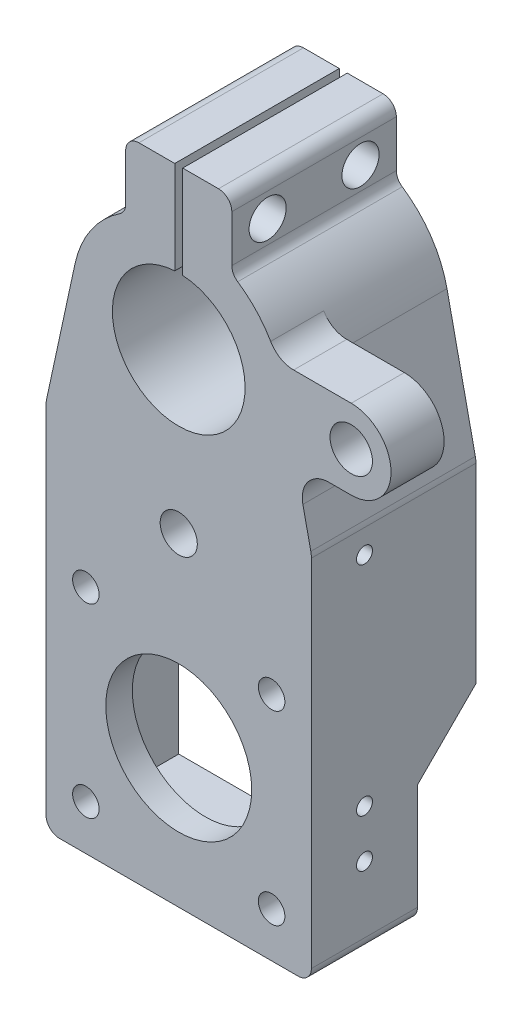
ISO-10303-21;
HEADER;
FILE_DESCRIPTION(('STEP AP214'),'2;1');
FILE_NAME('part.step','',(''),(''),'','','');
FILE_SCHEMA(('AUTOMOTIVE_DESIGN { 1 0 10303 214 1 1 1 1 }'));
ENDSEC;
DATA;
#1=APPLICATION_CONTEXT('core data for automotive mechanical design processes');
#2=APPLICATION_PROTOCOL_DEFINITION('international standard','automotive_design',2000,#1);
#3=PRODUCT_CONTEXT('',#1,'mechanical');
#4=PRODUCT('Part','Part','',(#3));
#5=PRODUCT_RELATED_PRODUCT_CATEGORY('part','',(#4));
#6=PRODUCT_DEFINITION_FORMATION('','',#4);
#7=PRODUCT_DEFINITION_CONTEXT('part definition',#1,'design');
#8=PRODUCT_DEFINITION('design','',#6,#7);
#9=PRODUCT_DEFINITION_SHAPE('','',#8);
#10=(LENGTH_UNIT() NAMED_UNIT(*) SI_UNIT(.MILLI.,.METRE.));
#11=(NAMED_UNIT(*) PLANE_ANGLE_UNIT() SI_UNIT($,.RADIAN.));
#12=(NAMED_UNIT(*) SI_UNIT($,.STERADIAN.) SOLID_ANGLE_UNIT());
#13=UNCERTAINTY_MEASURE_WITH_UNIT(LENGTH_MEASURE(1.E-05),#10,'distance_accuracy_value','');
#14=(GEOMETRIC_REPRESENTATION_CONTEXT(3) GLOBAL_UNCERTAINTY_ASSIGNED_CONTEXT((#13)) GLOBAL_UNIT_ASSIGNED_CONTEXT((#10,
#11,#12)) REPRESENTATION_CONTEXT('',''));
#15=CARTESIAN_POINT('',(0.,0.,0.));
#16=DIRECTION('',(0.,0.,1.));
#17=DIRECTION('',(1.,0.,0.));
#18=AXIS2_PLACEMENT_3D('',#15,#16,#17);
#19=CARTESIAN_POINT('',(0.,190.,20.));
#20=DIRECTION('',(0.,-1.,0.));
#21=DIRECTION('',(0.,0.,-1.));
#22=AXIS2_PLACEMENT_3D('',#19,#20,#21);
#23=PLANE('',#22);
#24=DIRECTION('',(-1.,0.,0.));
#25=VECTOR('',#24,1.);
#26=CARTESIAN_POINT('',(0.,190.,20.));
#27=LINE('',#26,#25);
#28=CARTESIAN_POINT('',(-1.5,190.,20.));
#29=VERTEX_POINT('',#28);
#30=CARTESIAN_POINT('',(-14.9999999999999,190.,20.));
#31=VERTEX_POINT('',#30);
#32=EDGE_CURVE('E397',#29,#31,#27,.T.);
#33=ORIENTED_EDGE('',*,*,#32,.F.);
#34=DIRECTION('',(0.,0.,1.));
#35=VECTOR('',#34,1.);
#36=CARTESIAN_POINT('',(-1.5,190.,-49.1065418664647));
#37=LINE('',#36,#35);
#38=CARTESIAN_POINT('',(-1.5,190.,-42.));
#39=VERTEX_POINT('',#38);
#40=EDGE_CURVE('E639',#39,#29,#37,.T.);
#41=ORIENTED_EDGE('',*,*,#40,.F.);
#42=DIRECTION('',(1.,0.,0.));
#43=VECTOR('',#42,1.);
#44=CARTESIAN_POINT('',(15.,190.,-42.));
#45=LINE('',#44,#43);
#46=CARTESIAN_POINT('',(-14.9999999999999,190.,-42.));
#47=VERTEX_POINT('',#46);
#48=EDGE_CURVE('E346',#47,#39,#45,.T.);
#49=ORIENTED_EDGE('',*,*,#48,.F.);
#50=DIRECTION('',(0.,0.,-1.));
#51=VECTOR('',#50,1.);
#52=CARTESIAN_POINT('',(-14.9999999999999,190.,20.));
#53=LINE('',#52,#51);
#54=EDGE_CURVE('E360',#31,#47,#53,.T.);
#55=ORIENTED_EDGE('',*,*,#54,.F.);
#56=EDGE_LOOP('',(#33,#41,#49,#55));
#57=FACE_BOUND('',#56,.T.);
#58=ADVANCED_FACE('F36',(#57),#23,.F.);
#59=CARTESIAN_POINT('',(-15.,185.,20.));
#60=DIRECTION('',(0.,0.,-1.));
#61=DIRECTION('',(-1.,0.,0.));
#62=AXIS2_PLACEMENT_3D('',#59,#60,#61);
#63=PLANE('',#62);
#64=CARTESIAN_POINT('',(0.,70.,20.));
#65=DIRECTION('',(0.,0.,-1.));
#66=DIRECTION('',(-1.,0.,0.));
#67=AXIS2_PLACEMENT_3D('',#64,#65,#66);
#68=CIRCLE('',#67,7.);
#69=CARTESIAN_POINT('',(7.,70.,20.));
#70=VERTEX_POINT('',#69);
#71=EDGE_CURVE('E552',#70,#70,#68,.T.);
#72=ORIENTED_EDGE('',*,*,#71,.T.);
#73=EDGE_LOOP('',(#72));
#74=FACE_BOUND('',#73,.T.);
#75=CARTESIAN_POINT('',(0.,130.,20.));
#76=DIRECTION('',(0.,0.,1.));
#77=DIRECTION('',(1.,0.,0.));
#78=AXIS2_PLACEMENT_3D('',#75,#76,#77);
#79=CIRCLE('',#78,25.);
#80=CARTESIAN_POINT('',(-1.5,154.954959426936,20.));
#81=VERTEX_POINT('',#80);
#82=CARTESIAN_POINT('',(1.5,154.954959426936,20.));
#83=VERTEX_POINT('',#82);
#84=EDGE_CURVE('E389',#81,#83,#79,.T.);
#85=ORIENTED_EDGE('',*,*,#84,.F.);
#86=DIRECTION('',(0.,1.,0.));
#87=VECTOR('',#86,1.);
#88=CARTESIAN_POINT('',(-1.5,185.,20.));
#89=LINE('',#88,#87);
#90=EDGE_CURVE('E651',#81,#29,#89,.T.);
#91=ORIENTED_EDGE('',*,*,#90,.T.);
#92=ORIENTED_EDGE('',*,*,#32,.T.);
#93=CARTESIAN_POINT('',(-15.,185.,20.));
#94=DIRECTION('',(0.,0.,1.));
#95=DIRECTION('',(-1.,0.,0.));
#96=AXIS2_PLACEMENT_3D('',#93,#94,#95);
#97=CIRCLE('',#96,5.);
#98=CARTESIAN_POINT('',(-20.,185.,20.));
#99=VERTEX_POINT('',#98);
#100=EDGE_CURVE('E396',#31,#99,#97,.T.);
#101=ORIENTED_EDGE('',*,*,#100,.T.);
#102=DIRECTION('',(0.,-1.,0.));
#103=VECTOR('',#102,1.);
#104=CARTESIAN_POINT('',(-20.,185.,20.));
#105=LINE('',#104,#103);
#106=CARTESIAN_POINT('',(-19.9999999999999,167.416573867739,20.));
#107=VERTEX_POINT('',#106);
#108=EDGE_CURVE('E399',#99,#107,#105,.T.);
#109=ORIENTED_EDGE('',*,*,#108,.T.);
#110=CARTESIAN_POINT('',(-24.9999999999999,167.416573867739,20.));
#111=DIRECTION('',(0.,0.,-1.));
#112=DIRECTION('',(-1.,0.,0.));
#113=AXIS2_PLACEMENT_3D('',#110,#111,#112);
#114=CIRCLE('',#113,4.99999999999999);
#115=CARTESIAN_POINT('',(-22.2222222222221,163.259176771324,20.));
#116=VERTEX_POINT('',#115);
#117=EDGE_CURVE('E401',#107,#116,#114,.T.);
#118=ORIENTED_EDGE('',*,*,#117,.T.);
#119=CARTESIAN_POINT('',(0.,130.,20.));
#120=DIRECTION('',(0.,0.,1.));
#121=DIRECTION('',(1.,0.,0.));
#122=AXIS2_PLACEMENT_3D('',#119,#120,#121);
#123=CIRCLE('',#122,39.9999999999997);
#124=CARTESIAN_POINT('',(-39.0974293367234,138.449320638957,20.));
#125=VERTEX_POINT('',#124);
#126=EDGE_CURVE('E403',#116,#125,#123,.T.);
#127=ORIENTED_EDGE('',*,*,#126,.T.);
#128=DIRECTION('',(-0.211233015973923,-0.97743573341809,0.));
#129=VECTOR('',#128,1.);
#130=CARTESIAN_POINT('',(-49.7743573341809,89.0441133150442,20.));
#131=LINE('',#130,#129);
#132=CARTESIAN_POINT('',(-49.7743573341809,89.0441133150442,20.));
#133=VERTEX_POINT('',#132);
#134=EDGE_CURVE('E405',#125,#133,#131,.T.);
#135=ORIENTED_EDGE('',*,*,#134,.T.);
#136=CARTESIAN_POINT('',(-40.,86.9317831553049,20.));
#137=DIRECTION('',(0.,0.,1.));
#138=DIRECTION('',(1.,0.,0.));
#139=AXIS2_PLACEMENT_3D('',#136,#137,#138);
#140=CIRCLE('',#139,10.);
#141=CARTESIAN_POINT('',(-50.,86.9317831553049,20.));
#142=VERTEX_POINT('',#141);
#143=EDGE_CURVE('E407',#133,#142,#140,.T.);
#144=ORIENTED_EDGE('',*,*,#143,.T.);
#145=DIRECTION('',(0.,-1.,0.));
#146=VECTOR('',#145,1.);
#147=CARTESIAN_POINT('',(-50.,-47.,20.));
#148=LINE('',#147,#146);
#149=CARTESIAN_POINT('',(-50.,-47.,20.));
#150=VERTEX_POINT('',#149);
#151=EDGE_CURVE('E409',#142,#150,#148,.T.);
#152=ORIENTED_EDGE('',*,*,#151,.T.);
#153=CARTESIAN_POINT('',(-45.,-47.,20.));
#154=DIRECTION('',(0.,0.,1.));
#155=DIRECTION('',(1.,0.,0.));
#156=AXIS2_PLACEMENT_3D('',#153,#154,#155);
#157=CIRCLE('',#156,5.);
#158=CARTESIAN_POINT('',(-45.,-52.,20.));
#159=VERTEX_POINT('',#158);
#160=EDGE_CURVE('E411',#150,#159,#157,.T.);
#161=ORIENTED_EDGE('',*,*,#160,.T.);
#162=DIRECTION('',(1.,0.,0.));
#163=VECTOR('',#162,1.);
#164=CARTESIAN_POINT('',(45.,-52.,20.));
#165=LINE('',#164,#163);
#166=CARTESIAN_POINT('',(45.,-52.,20.));
#167=VERTEX_POINT('',#166);
#168=EDGE_CURVE('E413',#159,#167,#165,.T.);
#169=ORIENTED_EDGE('',*,*,#168,.T.);
#170=CARTESIAN_POINT('',(45.,-47.,20.));
#171=DIRECTION('',(0.,0.,1.));
#172=DIRECTION('',(-1.,0.,0.));
#173=AXIS2_PLACEMENT_3D('',#170,#171,#172);
#174=CIRCLE('',#173,5.);
#175=CARTESIAN_POINT('',(50.,-47.,20.));
#176=VERTEX_POINT('',#175);
#177=EDGE_CURVE('E415',#167,#176,#174,.T.);
#178=ORIENTED_EDGE('',*,*,#177,.T.);
#179=DIRECTION('',(0.,1.,0.));
#180=VECTOR('',#179,1.);
#181=CARTESIAN_POINT('',(50.,86.9317831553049,20.));
#182=LINE('',#181,#180);
#183=CARTESIAN_POINT('',(50.,86.9317831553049,20.));
#184=VERTEX_POINT('',#183);
#185=EDGE_CURVE('E417',#176,#184,#182,.T.);
#186=ORIENTED_EDGE('',*,*,#185,.T.);
#187=CARTESIAN_POINT('',(40.,86.9317831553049,20.));
#188=DIRECTION('',(0.,0.,1.));
#189=DIRECTION('',(-1.,0.,0.));
#190=AXIS2_PLACEMENT_3D('',#187,#188,#189);
#191=CIRCLE('',#190,10.);
#192=CARTESIAN_POINT('',(49.7743573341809,89.0441133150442,20.));
#193=VERTEX_POINT('',#192);
#194=EDGE_CURVE('E419',#184,#193,#191,.T.);
#195=ORIENTED_EDGE('',*,*,#194,.T.);
#196=DIRECTION('',(-0.211233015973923,0.977435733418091,0.));
#197=VECTOR('',#196,1.);
#198=CARTESIAN_POINT('',(49.7743573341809,89.0441133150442,20.));
#199=LINE('',#198,#197);
#200=CARTESIAN_POINT('',(46.7826351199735,102.887669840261,20.));
#201=VERTEX_POINT('',#200);
#202=EDGE_CURVE('E421',#193,#201,#199,.T.);
#203=ORIENTED_EDGE('',*,*,#202,.T.);
#204=CARTESIAN_POINT('',(56.5569924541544,105.,20.));
#205=DIRECTION('',(0.,0.,-1.));
#206=DIRECTION('',(1.,0.,0.));
#207=AXIS2_PLACEMENT_3D('',#204,#205,#206);
#208=CIRCLE('',#207,9.99999999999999);
#209=CARTESIAN_POINT('',(56.5569924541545,115.,20.));
#210=VERTEX_POINT('',#209);
#211=EDGE_CURVE('E423',#201,#210,#208,.T.);
#212=ORIENTED_EDGE('',*,*,#211,.T.);
#213=DIRECTION('',(1.,0.,0.));
#214=VECTOR('',#213,1.);
#215=CARTESIAN_POINT('',(65.,115.,20.));
#216=LINE('',#215,#214);
#217=CARTESIAN_POINT('',(65.,115.,20.));
#218=VERTEX_POINT('',#217);
#219=EDGE_CURVE('E425',#210,#218,#216,.T.);
#220=ORIENTED_EDGE('',*,*,#219,.T.);
#221=CARTESIAN_POINT('',(65.,130.,20.));
#222=DIRECTION('',(0.,0.,1.));
#223=DIRECTION('',(1.,0.,0.));
#224=AXIS2_PLACEMENT_3D('',#221,#222,#223);
#225=CIRCLE('',#224,15.);
#226=CARTESIAN_POINT('',(65.,145.,20.));
#227=VERTEX_POINT('',#226);
#228=EDGE_CURVE('E427',#218,#227,#225,.T.);
#229=ORIENTED_EDGE('',*,*,#228,.T.);
#230=DIRECTION('',(-1.,0.,0.));
#231=VECTOR('',#230,1.);
#232=CARTESIAN_POINT('',(65.,145.,20.));
#233=LINE('',#232,#231);
#234=CARTESIAN_POINT('',(43.3012701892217,145.,20.));
#235=VERTEX_POINT('',#234);
#236=EDGE_CURVE('E429',#227,#235,#233,.T.);
#237=ORIENTED_EDGE('',*,*,#236,.T.);
#238=CARTESIAN_POINT('',(43.3012701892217,155.,20.));
#239=DIRECTION('',(0.,0.,-1.));
#240=DIRECTION('',(1.,0.,0.));
#241=AXIS2_PLACEMENT_3D('',#238,#239,#240);
#242=CIRCLE('',#241,10.);
#243=CARTESIAN_POINT('',(34.6410161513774,150.,20.));
#244=VERTEX_POINT('',#243);
#245=EDGE_CURVE('E431',#235,#244,#242,.T.);
#246=ORIENTED_EDGE('',*,*,#245,.T.);
#247=CARTESIAN_POINT('',(0.,130.,20.));
#248=DIRECTION('',(0.,0.,1.));
#249=DIRECTION('',(1.,0.,0.));
#250=AXIS2_PLACEMENT_3D('',#247,#248,#249);
#251=CIRCLE('',#250,39.9999999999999);
#252=CARTESIAN_POINT('',(22.2222222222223,163.259176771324,20.));
#253=VERTEX_POINT('',#252);
#254=EDGE_CURVE('E433',#244,#253,#251,.T.);
#255=ORIENTED_EDGE('',*,*,#254,.T.);
#256=CARTESIAN_POINT('',(25.0000000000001,167.416573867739,20.));
#257=DIRECTION('',(0.,0.,-1.));
#258=DIRECTION('',(1.,0.,0.));
#259=AXIS2_PLACEMENT_3D('',#256,#257,#258);
#260=CIRCLE('',#259,5.);
#261=CARTESIAN_POINT('',(20.0000000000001,167.416573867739,20.));
#262=VERTEX_POINT('',#261);
#263=EDGE_CURVE('E435',#253,#262,#260,.T.);
#264=ORIENTED_EDGE('',*,*,#263,.T.);
#265=DIRECTION('',(0.,1.,0.));
#266=VECTOR('',#265,1.);
#267=CARTESIAN_POINT('',(20.,185.,20.));
#268=LINE('',#267,#266);
#269=CARTESIAN_POINT('',(20.,185.,20.));
#270=VERTEX_POINT('',#269);
#271=EDGE_CURVE('E437',#262,#270,#268,.T.);
#272=ORIENTED_EDGE('',*,*,#271,.T.);
#273=CARTESIAN_POINT('',(15.,185.,20.));
#274=DIRECTION('',(0.,0.,1.));
#275=DIRECTION('',(-1.,0.,0.));
#276=AXIS2_PLACEMENT_3D('',#273,#274,#275);
#277=CIRCLE('',#276,5.);
#278=CARTESIAN_POINT('',(15.,190.,20.));
#279=VERTEX_POINT('',#278);
#280=EDGE_CURVE('E439',#270,#279,#277,.T.);
#281=ORIENTED_EDGE('',*,*,#280,.T.);
#282=CARTESIAN_POINT('',(1.5,190.,20.));
#283=VERTEX_POINT('',#282);
#284=EDGE_CURVE('E393',#279,#283,#27,.T.);
#285=ORIENTED_EDGE('',*,*,#284,.T.);
#286=DIRECTION('',(0.,-1.,0.));
#287=VECTOR('',#286,1.);
#288=CARTESIAN_POINT('',(1.5,185.,20.));
#289=LINE('',#288,#287);
#290=EDGE_CURVE('E647',#283,#83,#289,.T.);
#291=ORIENTED_EDGE('',*,*,#290,.T.);
#292=EDGE_LOOP('',(#85,#91,#92,#101,#109,#118,#127,#135,#144,#152,#161,#169,#178,#186,#195,#203,
#212,#220,#229,#237,#246,#255,#264,#272,#281,#285,#291));
#293=FACE_BOUND('',#292,.T.);
#294=CARTESIAN_POINT('',(0.,0.,20.));
#295=DIRECTION('',(0.,0.,1.));
#296=DIRECTION('',(1.,0.,0.));
#297=AXIS2_PLACEMENT_3D('',#294,#295,#296);
#298=CIRCLE('',#297,27.5);
#299=CARTESIAN_POINT('',(27.5,0.,20.));
#300=VERTEX_POINT('',#299);
#301=EDGE_CURVE('E384',#300,#300,#298,.T.);
#302=ORIENTED_EDGE('',*,*,#301,.F.);
#303=EDGE_LOOP('',(#302));
#304=FACE_BOUND('',#303,.T.);
#305=CARTESIAN_POINT('',(65.,130.,20.));
#306=DIRECTION('',(0.,0.,1.));
#307=DIRECTION('',(1.,0.,0.));
#308=AXIS2_PLACEMENT_3D('',#305,#306,#307);
#309=CIRCLE('',#308,8.00000000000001);
#310=CARTESIAN_POINT('',(73.,130.,20.));
#311=VERTEX_POINT('',#310);
#312=EDGE_CURVE('E381',#311,#311,#309,.T.);
#313=ORIENTED_EDGE('',*,*,#312,.F.);
#314=EDGE_LOOP('',(#313));
#315=FACE_BOUND('',#314,.T.);
#316=CARTESIAN_POINT('',(-35.,-35.,20.));
#317=DIRECTION('',(0.,0.,1.));
#318=DIRECTION('',(1.,0.,0.));
#319=AXIS2_PLACEMENT_3D('',#316,#317,#318);
#320=CIRCLE('',#319,5.);
#321=CARTESIAN_POINT('',(-30.,-35.,20.));
#322=VERTEX_POINT('',#321);
#323=EDGE_CURVE('E377',#322,#322,#320,.T.);
#324=ORIENTED_EDGE('',*,*,#323,.F.);
#325=EDGE_LOOP('',(#324));
#326=FACE_BOUND('',#325,.T.);
#327=CARTESIAN_POINT('',(-35.,35.,20.));
#328=DIRECTION('',(0.,0.,1.));
#329=DIRECTION('',(-1.,0.,0.));
#330=AXIS2_PLACEMENT_3D('',#327,#328,#329);
#331=CIRCLE('',#330,5.00000000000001);
#332=CARTESIAN_POINT('',(-40.,35.,20.));
#333=VERTEX_POINT('',#332);
#334=EDGE_CURVE('E374',#333,#333,#331,.T.);
#335=ORIENTED_EDGE('',*,*,#334,.F.);
#336=EDGE_LOOP('',(#335));
#337=FACE_BOUND('',#336,.T.);
#338=CARTESIAN_POINT('',(35.,-35.,20.));
#339=DIRECTION('',(0.,0.,1.));
#340=DIRECTION('',(-1.,0.,0.));
#341=AXIS2_PLACEMENT_3D('',#338,#339,#340);
#342=CIRCLE('',#341,5.);
#343=CARTESIAN_POINT('',(30.,-35.,20.));
#344=VERTEX_POINT('',#343);
#345=EDGE_CURVE('E371',#344,#344,#342,.T.);
#346=ORIENTED_EDGE('',*,*,#345,.F.);
#347=EDGE_LOOP('',(#346));
#348=FACE_BOUND('',#347,.T.);
#349=CARTESIAN_POINT('',(35.,35.,20.));
#350=DIRECTION('',(0.,0.,1.));
#351=DIRECTION('',(1.,0.,0.));
#352=AXIS2_PLACEMENT_3D('',#349,#350,#351);
#353=CIRCLE('',#352,5.00000000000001);
#354=CARTESIAN_POINT('',(40.,35.,20.));
#355=VERTEX_POINT('',#354);
#356=EDGE_CURVE('E368',#355,#355,#353,.T.);
#357=ORIENTED_EDGE('',*,*,#356,.F.);
#358=EDGE_LOOP('',(#357));
#359=FACE_BOUND('',#358,.T.);
#360=ADVANCED_FACE('F719',(#74,#293,#304,#315,#326,#337,#348,#359),#63,.F.);
#361=CARTESIAN_POINT('',(-15.,185.,0.));
#362=DIRECTION('',(0.,0.,-1.));
#363=DIRECTION('',(-1.,0.,0.));
#364=AXIS2_PLACEMENT_3D('',#361,#362,#363);
#365=PLANE('',#364);
#366=DIRECTION('',(0.211233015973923,-0.97743573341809,0.));
#367=VECTOR('',#366,1.);
#368=CARTESIAN_POINT('',(39.0974293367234,138.449320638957,0.));
#369=LINE('',#368,#367);
#370=CARTESIAN_POINT('',(39.0974293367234,138.449320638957,0.));
#371=VERTEX_POINT('',#370);
#372=CARTESIAN_POINT('',(46.7826351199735,102.887669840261,0.));
#373=VERTEX_POINT('',#372);
#374=EDGE_CURVE('E361',#371,#373,#369,.T.);
#375=ORIENTED_EDGE('',*,*,#374,.F.);
#376=CARTESIAN_POINT('',(0.,130.,0.));
#377=DIRECTION('',(0.,0.,-1.));
#378=DIRECTION('',(1.,0.,0.));
#379=AXIS2_PLACEMENT_3D('',#376,#377,#378);
#380=CIRCLE('',#379,39.9999999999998);
#381=CARTESIAN_POINT('',(34.6410161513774,150.,0.));
#382=VERTEX_POINT('',#381);
#383=EDGE_CURVE('E356',#382,#371,#380,.T.);
#384=ORIENTED_EDGE('',*,*,#383,.F.);
#385=CARTESIAN_POINT('',(43.3012701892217,155.,0.));
#386=DIRECTION('',(0.,0.,-1.));
#387=DIRECTION('',(1.,0.,0.));
#388=AXIS2_PLACEMENT_3D('',#385,#386,#387);
#389=CIRCLE('',#388,10.);
#390=CARTESIAN_POINT('',(43.3012701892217,145.,0.));
#391=VERTEX_POINT('',#390);
#392=EDGE_CURVE('E450',#391,#382,#389,.T.);
#393=ORIENTED_EDGE('',*,*,#392,.F.);
#394=DIRECTION('',(-1.,0.,0.));
#395=VECTOR('',#394,1.);
#396=CARTESIAN_POINT('',(65.,145.,0.));
#397=LINE('',#396,#395);
#398=CARTESIAN_POINT('',(65.,145.,0.));
#399=VERTEX_POINT('',#398);
#400=EDGE_CURVE('E448',#399,#391,#397,.T.);
#401=ORIENTED_EDGE('',*,*,#400,.F.);
#402=CARTESIAN_POINT('',(65.,130.,0.));
#403=DIRECTION('',(0.,0.,1.));
#404=DIRECTION('',(1.,0.,0.));
#405=AXIS2_PLACEMENT_3D('',#402,#403,#404);
#406=CIRCLE('',#405,15.);
#407=CARTESIAN_POINT('',(65.,115.,0.));
#408=VERTEX_POINT('',#407);
#409=EDGE_CURVE('E446',#408,#399,#406,.T.);
#410=ORIENTED_EDGE('',*,*,#409,.F.);
#411=DIRECTION('',(1.,0.,0.));
#412=VECTOR('',#411,1.);
#413=CARTESIAN_POINT('',(65.,115.,0.));
#414=LINE('',#413,#412);
#415=CARTESIAN_POINT('',(56.5569924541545,115.,0.));
#416=VERTEX_POINT('',#415);
#417=EDGE_CURVE('E444',#416,#408,#414,.T.);
#418=ORIENTED_EDGE('',*,*,#417,.F.);
#419=CARTESIAN_POINT('',(56.5569924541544,105.,0.));
#420=DIRECTION('',(0.,0.,-1.));
#421=DIRECTION('',(1.,0.,0.));
#422=AXIS2_PLACEMENT_3D('',#419,#420,#421);
#423=CIRCLE('',#422,9.99999999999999);
#424=EDGE_CURVE('E392',#373,#416,#423,.T.);
#425=ORIENTED_EDGE('',*,*,#424,.F.);
#426=EDGE_LOOP('',(#375,#384,#393,#401,#410,#418,#425));
#427=FACE_BOUND('',#426,.T.);
#428=CARTESIAN_POINT('',(65.,130.,0.));
#429=DIRECTION('',(0.,0.,1.));
#430=DIRECTION('',(1.,0.,0.));
#431=AXIS2_PLACEMENT_3D('',#428,#429,#430);
#432=CIRCLE('',#431,8.00000000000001);
#433=CARTESIAN_POINT('',(73.,130.,0.));
#434=VERTEX_POINT('',#433);
#435=EDGE_CURVE('E380',#434,#434,#432,.T.);
#436=ORIENTED_EDGE('',*,*,#435,.T.);
#437=EDGE_LOOP('',(#436));
#438=FACE_BOUND('',#437,.T.);
#439=ADVANCED_FACE('F721',(#427,#438),#365,.T.);
#440=CARTESIAN_POINT('',(-15.,185.,20.));
#441=DIRECTION('',(0.,0.,-1.));
#442=DIRECTION('',(-1.,0.,0.));
#443=AXIS2_PLACEMENT_3D('',#440,#441,#442);
#444=CYLINDRICAL_SURFACE('',#443,5.);
#445=ORIENTED_EDGE('',*,*,#54,.T.);
#446=CARTESIAN_POINT('',(-15.,185.,-42.));
#447=DIRECTION('',(0.,0.,-1.));
#448=DIRECTION('',(-1.,0.,0.));
#449=AXIS2_PLACEMENT_3D('',#446,#447,#448);
#450=CIRCLE('',#449,5.);
#451=CARTESIAN_POINT('',(-20.,185.,-42.));
#452=VERTEX_POINT('',#451);
#453=EDGE_CURVE('E342',#452,#47,#450,.T.);
#454=ORIENTED_EDGE('',*,*,#453,.F.);
#455=DIRECTION('',(0.,0.,-1.));
#456=VECTOR('',#455,1.);
#457=CARTESIAN_POINT('',(-20.,185.,20.));
#458=LINE('',#457,#456);
#459=EDGE_CURVE('E503',#99,#452,#458,.T.);
#460=ORIENTED_EDGE('',*,*,#459,.F.);
#461=ORIENTED_EDGE('',*,*,#100,.F.);
#462=EDGE_LOOP('',(#445,#454,#460,#461));
#463=FACE_BOUND('',#462,.T.);
#464=ADVANCED_FACE('F38',(#463),#444,.T.);
#465=CARTESIAN_POINT('',(-20.,185.,20.));
#466=DIRECTION('',(1.,0.,0.));
#467=DIRECTION('',(0.,1.,0.));
#468=AXIS2_PLACEMENT_3D('',#465,#466,#467);
#469=PLANE('',#468);
#470=CARTESIAN_POINT('',(-20.,176.,-28.5));
#471=DIRECTION('',(1.,0.,0.));
#472=DIRECTION('',(0.,1.,0.));
#473=AXIS2_PLACEMENT_3D('',#470,#471,#472);
#474=CIRCLE('',#473,4.5);
#475=CARTESIAN_POINT('',(-20.,180.5,-28.5));
#476=VERTEX_POINT('',#475);
#477=EDGE_CURVE('E608',#476,#476,#474,.F.);
#478=ORIENTED_EDGE('',*,*,#477,.F.);
#479=EDGE_LOOP('',(#478));
#480=FACE_BOUND('',#479,.T.);
#481=CARTESIAN_POINT('',(-20.,176.,6.5));
#482=DIRECTION('',(1.,0.,0.));
#483=DIRECTION('',(0.,1.,0.));
#484=AXIS2_PLACEMENT_3D('',#481,#482,#483);
#485=CIRCLE('',#484,4.5);
#486=CARTESIAN_POINT('',(-20.,180.5,6.5));
#487=VERTEX_POINT('',#486);
#488=EDGE_CURVE('E620',#487,#487,#485,.F.);
#489=ORIENTED_EDGE('',*,*,#488,.F.);
#490=EDGE_LOOP('',(#489));
#491=FACE_BOUND('',#490,.T.);
#492=ORIENTED_EDGE('',*,*,#459,.T.);
#493=DIRECTION('',(0.,1.,0.));
#494=VECTOR('',#493,1.);
#495=CARTESIAN_POINT('',(-20.,185.,-42.));
#496=LINE('',#495,#494);
#497=CARTESIAN_POINT('',(-19.9999999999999,167.416573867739,-42.));
#498=VERTEX_POINT('',#497);
#499=EDGE_CURVE('E339',#498,#452,#496,.T.);
#500=ORIENTED_EDGE('',*,*,#499,.F.);
#501=DIRECTION('',(0.,0.,-1.));
#502=VECTOR('',#501,1.);
#503=CARTESIAN_POINT('',(-19.9999999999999,167.416573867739,20.));
#504=LINE('',#503,#502);
#505=EDGE_CURVE('E501',#107,#498,#504,.T.);
#506=ORIENTED_EDGE('',*,*,#505,.F.);
#507=ORIENTED_EDGE('',*,*,#108,.F.);
#508=EDGE_LOOP('',(#492,#500,#506,#507));
#509=FACE_BOUND('',#508,.T.);
#510=ADVANCED_FACE('F814',(#480,#491,#509),#469,.F.);
#511=CARTESIAN_POINT('',(-24.9999999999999,167.416573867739,20.));
#512=DIRECTION('',(0.,0.,-1.));
#513=DIRECTION('',(-1.,0.,0.));
#514=AXIS2_PLACEMENT_3D('',#511,#512,#513);
#515=CYLINDRICAL_SURFACE('',#514,4.99999999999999);
#516=ORIENTED_EDGE('',*,*,#505,.T.);
#517=CARTESIAN_POINT('',(-24.9999999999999,167.416573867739,-42.));
#518=DIRECTION('',(0.,0.,1.));
#519=DIRECTION('',(-1.,0.,0.));
#520=AXIS2_PLACEMENT_3D('',#517,#518,#519);
#521=CIRCLE('',#520,4.99999999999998);
#522=CARTESIAN_POINT('',(-22.2222222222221,163.259176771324,-42.));
#523=VERTEX_POINT('',#522);
#524=EDGE_CURVE('E336',#523,#498,#521,.T.);
#525=ORIENTED_EDGE('',*,*,#524,.F.);
#526=DIRECTION('',(0.,0.,-1.));
#527=VECTOR('',#526,1.);
#528=CARTESIAN_POINT('',(-22.2222222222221,163.259176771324,20.));
#529=LINE('',#528,#527);
#530=EDGE_CURVE('E499',#116,#523,#529,.T.);
#531=ORIENTED_EDGE('',*,*,#530,.F.);
#532=ORIENTED_EDGE('',*,*,#117,.F.);
#533=EDGE_LOOP('',(#516,#525,#531,#532));
#534=FACE_BOUND('',#533,.T.);
#535=ADVANCED_FACE('F811',(#534),#515,.F.);
#536=CARTESIAN_POINT('',(0.,130.,20.));
#537=DIRECTION('',(0.,0.,-1.));
#538=DIRECTION('',(-1.,0.,0.));
#539=AXIS2_PLACEMENT_3D('',#536,#537,#538);
#540=CYLINDRICAL_SURFACE('',#539,39.9999999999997);
#541=ORIENTED_EDGE('',*,*,#530,.T.);
#542=CARTESIAN_POINT('',(0.,130.,-42.));
#543=DIRECTION('',(0.,0.,-1.));
#544=DIRECTION('',(-1.,0.,0.));
#545=AXIS2_PLACEMENT_3D('',#542,#543,#544);
#546=CIRCLE('',#545,39.9999999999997);
#547=CARTESIAN_POINT('',(-39.0974293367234,138.449320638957,-42.));
#548=VERTEX_POINT('',#547);
#549=EDGE_CURVE('E333',#548,#523,#546,.T.);
#550=ORIENTED_EDGE('',*,*,#549,.F.);
#551=DIRECTION('',(0.,0.,-1.));
#552=VECTOR('',#551,1.);
#553=CARTESIAN_POINT('',(-39.0974293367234,138.449320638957,20.));
#554=LINE('',#553,#552);
#555=EDGE_CURVE('E497',#125,#548,#554,.T.);
#556=ORIENTED_EDGE('',*,*,#555,.F.);
#557=ORIENTED_EDGE('',*,*,#126,.F.);
#558=EDGE_LOOP('',(#541,#550,#556,#557));
#559=FACE_BOUND('',#558,.T.);
#560=ADVANCED_FACE('F807',(#559),#540,.T.);
#561=CARTESIAN_POINT('',(-49.7743573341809,89.0441133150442,20.));
#562=DIRECTION('',(0.97743573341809,-0.211233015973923,0.));
#563=DIRECTION('',(0.211233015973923,0.97743573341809,0.));
#564=AXIS2_PLACEMENT_3D('',#561,#562,#563);
#565=PLANE('',#564);
#566=CARTESIAN_POINT('',(-45.645652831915,108.148812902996,-9.99999999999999));
#567=DIRECTION('',(-0.97743573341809,0.211233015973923,0.));
#568=DIRECTION('',(-0.211233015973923,-0.97743573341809,0.));
#569=AXIS2_PLACEMENT_3D('',#566,#567,#568);
#570=CIRCLE('',#569,2.5);
#571=CARTESIAN_POINT('',(-46.1737353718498,105.705223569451,-9.99999999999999));
#572=VERTEX_POINT('',#571);
#573=EDGE_CURVE('E1314',#572,#572,#570,.T.);
#574=ORIENTED_EDGE('',*,*,#573,.F.);
#575=EDGE_LOOP('',(#574));
#576=FACE_BOUND('',#575,.T.);
#577=CARTESIAN_POINT('',(-43.1108566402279,119.878041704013,-10.));
#578=DIRECTION('',(-0.97743573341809,0.211233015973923,0.));
#579=DIRECTION('',(-0.211233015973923,-0.97743573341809,0.));
#580=AXIS2_PLACEMENT_3D('',#577,#578,#579);
#581=CIRCLE('',#580,2.5);
#582=CARTESIAN_POINT('',(-43.6389391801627,117.434452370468,-10.));
#583=VERTEX_POINT('',#582);
#584=EDGE_CURVE('E1313',#583,#583,#581,.T.);
#585=ORIENTED_EDGE('',*,*,#584,.F.);
#586=EDGE_LOOP('',(#585));
#587=FACE_BOUND('',#586,.T.);
#588=ORIENTED_EDGE('',*,*,#555,.T.);
#589=DIRECTION('',(0.211233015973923,0.97743573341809,0.));
#590=VECTOR('',#589,1.);
#591=CARTESIAN_POINT('',(-39.0974293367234,138.449320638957,-42.));
#592=LINE('',#591,#590);
#593=CARTESIAN_POINT('',(-49.7743573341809,89.0441133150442,-42.));
#594=VERTEX_POINT('',#593);
#595=EDGE_CURVE('E324',#594,#548,#592,.T.);
#596=ORIENTED_EDGE('',*,*,#595,.F.);
#597=DIRECTION('',(0.,0.,-1.));
#598=VECTOR('',#597,1.);
#599=CARTESIAN_POINT('',(-49.7743573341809,89.0441133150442,20.));
#600=LINE('',#599,#598);
#601=EDGE_CURVE('E495',#133,#594,#600,.T.);
#602=ORIENTED_EDGE('',*,*,#601,.F.);
#603=ORIENTED_EDGE('',*,*,#134,.F.);
#604=EDGE_LOOP('',(#588,#596,#602,#603));
#605=FACE_BOUND('',#604,.T.);
#606=ADVANCED_FACE('F803',(#576,#587,#605),#565,.F.);
#607=CARTESIAN_POINT('',(-40.,86.9317831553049,20.));
#608=DIRECTION('',(0.,0.,-1.));
#609=DIRECTION('',(-1.,0.,0.));
#610=AXIS2_PLACEMENT_3D('',#607,#608,#609);
#611=CYLINDRICAL_SURFACE('',#610,10.);
#612=ORIENTED_EDGE('',*,*,#601,.T.);
#613=CARTESIAN_POINT('',(-40.,86.9317831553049,-42.));
#614=DIRECTION('',(0.,0.,-1.));
#615=DIRECTION('',(-1.,0.,0.));
#616=AXIS2_PLACEMENT_3D('',#613,#614,#615);
#617=CIRCLE('',#616,10.);
#618=CARTESIAN_POINT('',(-50.,86.9317831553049,-42.));
#619=VERTEX_POINT('',#618);
#620=EDGE_CURVE('E321',#619,#594,#617,.T.);
#621=ORIENTED_EDGE('',*,*,#620,.F.);
#622=DIRECTION('',(0.,0.,-1.));
#623=VECTOR('',#622,1.);
#624=CARTESIAN_POINT('',(-50.,86.9317831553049,20.));
#625=LINE('',#624,#623);
#626=EDGE_CURVE('E319',#142,#619,#625,.T.);
#627=ORIENTED_EDGE('',*,*,#626,.F.);
#628=ORIENTED_EDGE('',*,*,#143,.F.);
#629=EDGE_LOOP('',(#612,#621,#627,#628));
#630=FACE_BOUND('',#629,.T.);
#631=ADVANCED_FACE('F800',(#630),#611,.T.);
#632=CARTESIAN_POINT('',(-50.,-47.,20.));
#633=DIRECTION('',(1.,0.,0.));
#634=DIRECTION('',(0.,0.,-1.));
#635=AXIS2_PLACEMENT_3D('',#632,#633,#634);
#636=PLANE('',#635);
#637=DIRECTION('',(0.,-0.707106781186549,0.707106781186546));
#638=VECTOR('',#637,1.);
#639=CARTESIAN_POINT('',(-50.,-7.,-20.));
#640=LINE('',#639,#638);
#641=CARTESIAN_POINT('',(-50.,15.0000000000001,-42.));
#642=VERTEX_POINT('',#641);
#643=CARTESIAN_POINT('',(-50.,-7.,-20.));
#644=VERTEX_POINT('',#643);
#645=EDGE_CURVE('E293',#642,#644,#640,.T.);
#646=ORIENTED_EDGE('',*,*,#645,.T.);
#647=DIRECTION('',(0.,-1.,0.));
#648=VECTOR('',#647,1.);
#649=CARTESIAN_POINT('',(-50.,-7.,-20.));
#650=LINE('',#649,#648);
#651=CARTESIAN_POINT('',(-50.,-47.,-20.));
#652=VERTEX_POINT('',#651);
#653=EDGE_CURVE('E302',#644,#652,#650,.T.);
#654=ORIENTED_EDGE('',*,*,#653,.T.);
#655=DIRECTION('',(0.,0.,-1.));
#656=VECTOR('',#655,1.);
#657=CARTESIAN_POINT('',(-50.,-47.,20.));
#658=LINE('',#657,#656);
#659=EDGE_CURVE('E491',#150,#652,#658,.T.);
#660=ORIENTED_EDGE('',*,*,#659,.F.);
#661=ORIENTED_EDGE('',*,*,#151,.F.);
#662=ORIENTED_EDGE('',*,*,#626,.T.);
#663=DIRECTION('',(0.,1.,0.));
#664=VECTOR('',#663,1.);
#665=CARTESIAN_POINT('',(-50.,86.9317831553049,-42.));
#666=LINE('',#665,#664);
#667=EDGE_CURVE('E309',#642,#619,#666,.T.);
#668=ORIENTED_EDGE('',*,*,#667,.F.);
#669=EDGE_LOOP('',(#646,#654,#660,#661,#662,#668));
#670=FACE_BOUND('',#669,.T.);
#671=ADVANCED_FACE('F316',(#670),#636,.F.);
#672=CARTESIAN_POINT('',(-45.,-47.,20.));
#673=DIRECTION('',(0.,0.,-1.));
#674=DIRECTION('',(-1.,0.,0.));
#675=AXIS2_PLACEMENT_3D('',#672,#673,#674);
#676=CYLINDRICAL_SURFACE('',#675,5.);
#677=ORIENTED_EDGE('',*,*,#659,.T.);
#678=CARTESIAN_POINT('',(-45.,-47.,-20.));
#679=DIRECTION('',(0.,0.,1.));
#680=DIRECTION('',(0.,-1.,0.));
#681=AXIS2_PLACEMENT_3D('',#678,#679,#680);
#682=CIRCLE('',#681,5.);
#683=CARTESIAN_POINT('',(-45.,-52.,-20.));
#684=VERTEX_POINT('',#683);
#685=EDGE_CURVE('E599',#652,#684,#682,.T.);
#686=ORIENTED_EDGE('',*,*,#685,.T.);
#687=DIRECTION('',(0.,0.,-1.));
#688=VECTOR('',#687,1.);
#689=CARTESIAN_POINT('',(-45.,-52.,20.));
#690=LINE('',#689,#688);
#691=EDGE_CURVE('E488',#159,#684,#690,.T.);
#692=ORIENTED_EDGE('',*,*,#691,.F.);
#693=ORIENTED_EDGE('',*,*,#160,.F.);
#694=EDGE_LOOP('',(#677,#686,#692,#693));
#695=FACE_BOUND('',#694,.T.);
#696=ADVANCED_FACE('F793',(#695),#676,.T.);
#697=CARTESIAN_POINT('',(45.,-52.,20.));
#698=DIRECTION('',(0.,1.,0.));
#699=DIRECTION('',(-1.,0.,0.));
#700=AXIS2_PLACEMENT_3D('',#697,#698,#699);
#701=PLANE('',#700);
#702=ORIENTED_EDGE('',*,*,#691,.T.);
#703=DIRECTION('',(1.,0.,0.));
#704=VECTOR('',#703,1.);
#705=CARTESIAN_POINT('',(-50.,-52.,-20.));
#706=LINE('',#705,#704);
#707=CARTESIAN_POINT('',(45.,-52.,-20.));
#708=VERTEX_POINT('',#707);
#709=EDGE_CURVE('E589',#684,#708,#706,.T.);
#710=ORIENTED_EDGE('',*,*,#709,.T.);
#711=DIRECTION('',(0.,0.,-1.));
#712=VECTOR('',#711,1.);
#713=CARTESIAN_POINT('',(45.,-52.,20.));
#714=LINE('',#713,#712);
#715=EDGE_CURVE('E485',#167,#708,#714,.T.);
#716=ORIENTED_EDGE('',*,*,#715,.F.);
#717=ORIENTED_EDGE('',*,*,#168,.F.);
#718=EDGE_LOOP('',(#702,#710,#716,#717));
#719=FACE_BOUND('',#718,.T.);
#720=ADVANCED_FACE('F789',(#719),#701,.F.);
#721=CARTESIAN_POINT('',(45.,-47.,20.));
#722=DIRECTION('',(0.,0.,-1.));
#723=DIRECTION('',(-1.,0.,0.));
#724=AXIS2_PLACEMENT_3D('',#721,#722,#723);
#725=CYLINDRICAL_SURFACE('',#724,5.);
#726=ORIENTED_EDGE('',*,*,#715,.T.);
#727=CARTESIAN_POINT('',(45.,-47.,-20.));
#728=DIRECTION('',(0.,0.,1.));
#729=DIRECTION('',(0.,-1.,0.));
#730=AXIS2_PLACEMENT_3D('',#727,#728,#729);
#731=CIRCLE('',#730,5.);
#732=CARTESIAN_POINT('',(50.,-46.9999999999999,-20.));
#733=VERTEX_POINT('',#732);
#734=EDGE_CURVE('E596',#708,#733,#731,.T.);
#735=ORIENTED_EDGE('',*,*,#734,.T.);
#736=DIRECTION('',(0.,0.,-1.));
#737=VECTOR('',#736,1.);
#738=CARTESIAN_POINT('',(50.,-47.,20.));
#739=LINE('',#738,#737);
#740=EDGE_CURVE('E482',#176,#733,#739,.T.);
#741=ORIENTED_EDGE('',*,*,#740,.F.);
#742=ORIENTED_EDGE('',*,*,#177,.F.);
#743=EDGE_LOOP('',(#726,#735,#741,#742));
#744=FACE_BOUND('',#743,.T.);
#745=ADVANCED_FACE('F785',(#744),#725,.T.);
#746=CARTESIAN_POINT('',(50.,86.9317831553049,20.));
#747=DIRECTION('',(-1.,0.,0.));
#748=DIRECTION('',(0.,-1.,0.));
#749=AXIS2_PLACEMENT_3D('',#746,#747,#748);
#750=PLANE('',#749);
#751=CARTESIAN_POINT('',(50.,-4.,0.));
#752=DIRECTION('',(1.,0.,0.));
#753=DIRECTION('',(0.,1.,0.));
#754=AXIS2_PLACEMENT_3D('',#751,#752,#753);
#755=CIRCLE('',#754,3.);
#756=CARTESIAN_POINT('',(50.,-0.999999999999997,0.));
#757=VERTEX_POINT('',#756);
#758=EDGE_CURVE('E1328',#757,#757,#755,.T.);
#759=ORIENTED_EDGE('',*,*,#758,.F.);
#760=EDGE_LOOP('',(#759));
#761=FACE_BOUND('',#760,.T.);
#762=CARTESIAN_POINT('',(50.,78.,0.));
#763=DIRECTION('',(1.,0.,0.));
#764=DIRECTION('',(0.,1.,0.));
#765=AXIS2_PLACEMENT_3D('',#762,#763,#764);
#766=CIRCLE('',#765,3.);
#767=CARTESIAN_POINT('',(50.,81.,0.));
#768=VERTEX_POINT('',#767);
#769=EDGE_CURVE('E1323',#768,#768,#766,.T.);
#770=ORIENTED_EDGE('',*,*,#769,.F.);
#771=EDGE_LOOP('',(#770));
#772=FACE_BOUND('',#771,.T.);
#773=CARTESIAN_POINT('',(50.,-22.,0.));
#774=DIRECTION('',(1.,0.,0.));
#775=DIRECTION('',(0.,1.,0.));
#776=AXIS2_PLACEMENT_3D('',#773,#774,#775);
#777=CIRCLE('',#776,3.);
#778=CARTESIAN_POINT('',(50.,-19.,0.));
#779=VERTEX_POINT('',#778);
#780=EDGE_CURVE('E585',#779,#779,#777,.T.);
#781=ORIENTED_EDGE('',*,*,#780,.F.);
#782=EDGE_LOOP('',(#781));
#783=FACE_BOUND('',#782,.T.);
#784=ORIENTED_EDGE('',*,*,#740,.T.);
#785=DIRECTION('',(0.,-1.,0.));
#786=VECTOR('',#785,1.);
#787=CARTESIAN_POINT('',(50.,-7.,-20.));
#788=LINE('',#787,#786);
#789=CARTESIAN_POINT('',(50.,-7.,-20.));
#790=VERTEX_POINT('',#789);
#791=EDGE_CURVE('E303',#790,#733,#788,.T.);
#792=ORIENTED_EDGE('',*,*,#791,.F.);
#793=DIRECTION('',(0.,-0.707106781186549,0.707106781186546));
#794=VECTOR('',#793,1.);
#795=CARTESIAN_POINT('',(50.,-7.,-20.));
#796=LINE('',#795,#794);
#797=CARTESIAN_POINT('',(50.,15.0000000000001,-42.));
#798=VERTEX_POINT('',#797);
#799=EDGE_CURVE('E578',#798,#790,#796,.T.);
#800=ORIENTED_EDGE('',*,*,#799,.F.);
#801=DIRECTION('',(0.,-1.,0.));
#802=VECTOR('',#801,1.);
#803=CARTESIAN_POINT('',(50.,86.9317831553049,-42.));
#804=LINE('',#803,#802);
#805=CARTESIAN_POINT('',(50.,86.9317831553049,-42.));
#806=VERTEX_POINT('',#805);
#807=EDGE_CURVE('E322',#806,#798,#804,.T.);
#808=ORIENTED_EDGE('',*,*,#807,.F.);
#809=DIRECTION('',(0.,0.,-1.));
#810=VECTOR('',#809,1.);
#811=CARTESIAN_POINT('',(50.,86.9317831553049,20.));
#812=LINE('',#811,#810);
#813=EDGE_CURVE('E480',#184,#806,#812,.T.);
#814=ORIENTED_EDGE('',*,*,#813,.F.);
#815=ORIENTED_EDGE('',*,*,#185,.F.);
#816=EDGE_LOOP('',(#784,#792,#800,#808,#814,#815));
#817=FACE_BOUND('',#816,.T.);
#818=ADVANCED_FACE('F573',(#761,#772,#783,#817),#750,.F.);
#819=CARTESIAN_POINT('',(40.,86.9317831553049,20.));
#820=DIRECTION('',(0.,0.,-1.));
#821=DIRECTION('',(-1.,0.,0.));
#822=AXIS2_PLACEMENT_3D('',#819,#820,#821);
#823=CYLINDRICAL_SURFACE('',#822,10.);
#824=ORIENTED_EDGE('',*,*,#813,.T.);
#825=CARTESIAN_POINT('',(40.,86.9317831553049,-42.));
#826=DIRECTION('',(0.,0.,-1.));
#827=DIRECTION('',(1.,0.,0.));
#828=AXIS2_PLACEMENT_3D('',#825,#826,#827);
#829=CIRCLE('',#828,10.);
#830=CARTESIAN_POINT('',(49.7743573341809,89.0441133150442,-42.));
#831=VERTEX_POINT('',#830);
#832=EDGE_CURVE('E327',#831,#806,#829,.T.);
#833=ORIENTED_EDGE('',*,*,#832,.F.);
#834=DIRECTION('',(0.,0.,-1.));
#835=VECTOR('',#834,1.);
#836=CARTESIAN_POINT('',(49.7743573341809,89.0441133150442,20.));
#837=LINE('',#836,#835);
#838=EDGE_CURVE('E478',#193,#831,#837,.T.);
#839=ORIENTED_EDGE('',*,*,#838,.F.);
#840=ORIENTED_EDGE('',*,*,#194,.F.);
#841=EDGE_LOOP('',(#824,#833,#839,#840));
#842=FACE_BOUND('',#841,.T.);
#843=ADVANCED_FACE('F779',(#842),#823,.T.);
#844=CARTESIAN_POINT('',(49.7743573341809,89.0441133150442,20.));
#845=DIRECTION('',(-0.97743573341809,-0.211233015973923,0.));
#846=DIRECTION('',(0.211233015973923,-0.97743573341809,0.));
#847=AXIS2_PLACEMENT_3D('',#844,#845,#846);
#848=PLANE('',#847);
#849=ORIENTED_EDGE('',*,*,#838,.T.);
#850=DIRECTION('',(0.211233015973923,-0.97743573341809,0.));
#851=VECTOR('',#850,1.);
#852=CARTESIAN_POINT('',(39.0974293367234,138.449320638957,-42.));
#853=LINE('',#852,#851);
#854=CARTESIAN_POINT('',(39.0974293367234,138.449320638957,-42.));
#855=VERTEX_POINT('',#854);
#856=EDGE_CURVE('E561',#855,#831,#853,.T.);
#857=ORIENTED_EDGE('',*,*,#856,.F.);
#858=DIRECTION('',(0.,0.,1.));
#859=VECTOR('',#858,1.);
#860=CARTESIAN_POINT('',(39.0974293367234,138.449320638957,-42.));
#861=LINE('',#860,#859);
#862=EDGE_CURVE('E355',#855,#371,#861,.T.);
#863=ORIENTED_EDGE('',*,*,#862,.T.);
#864=ORIENTED_EDGE('',*,*,#374,.T.);
#865=DIRECTION('',(0.,0.,-1.));
#866=VECTOR('',#865,1.);
#867=CARTESIAN_POINT('',(46.7826351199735,102.887669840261,20.));
#868=LINE('',#867,#866);
#869=EDGE_CURVE('E476',#201,#373,#868,.T.);
#870=ORIENTED_EDGE('',*,*,#869,.F.);
#871=ORIENTED_EDGE('',*,*,#202,.F.);
#872=EDGE_LOOP('',(#849,#857,#863,#864,#870,#871));
#873=FACE_BOUND('',#872,.T.);
#874=ADVANCED_FACE('F775',(#873),#848,.F.);
#875=CARTESIAN_POINT('',(56.5569924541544,105.,20.));
#876=DIRECTION('',(0.,0.,-1.));
#877=DIRECTION('',(-1.,0.,0.));
#878=AXIS2_PLACEMENT_3D('',#875,#876,#877);
#879=CYLINDRICAL_SURFACE('',#878,9.99999999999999);
#880=ORIENTED_EDGE('',*,*,#424,.T.);
#881=DIRECTION('',(0.,0.,-1.));
#882=VECTOR('',#881,1.);
#883=CARTESIAN_POINT('',(56.5569924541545,115.,20.));
#884=LINE('',#883,#882);
#885=EDGE_CURVE('E473',#210,#416,#884,.T.);
#886=ORIENTED_EDGE('',*,*,#885,.F.);
#887=ORIENTED_EDGE('',*,*,#211,.F.);
#888=ORIENTED_EDGE('',*,*,#869,.T.);
#889=EDGE_LOOP('',(#880,#886,#887,#888));
#890=FACE_BOUND('',#889,.T.);
#891=ADVANCED_FACE('F771',(#890),#879,.F.);
#892=CARTESIAN_POINT('',(65.,115.,20.));
#893=DIRECTION('',(0.,1.,0.));
#894=DIRECTION('',(0.,0.,1.));
#895=AXIS2_PLACEMENT_3D('',#892,#893,#894);
#896=PLANE('',#895);
#897=ORIENTED_EDGE('',*,*,#417,.T.);
#898=DIRECTION('',(0.,0.,-1.));
#899=VECTOR('',#898,1.);
#900=CARTESIAN_POINT('',(65.,115.,20.));
#901=LINE('',#900,#899);
#902=EDGE_CURVE('E470',#218,#408,#901,.T.);
#903=ORIENTED_EDGE('',*,*,#902,.F.);
#904=ORIENTED_EDGE('',*,*,#219,.F.);
#905=ORIENTED_EDGE('',*,*,#885,.T.);
#906=EDGE_LOOP('',(#897,#903,#904,#905));
#907=FACE_BOUND('',#906,.T.);
#908=ADVANCED_FACE('F767',(#907),#896,.F.);
#909=CARTESIAN_POINT('',(65.,130.,20.));
#910=DIRECTION('',(0.,0.,-1.));
#911=DIRECTION('',(-1.,0.,0.));
#912=AXIS2_PLACEMENT_3D('',#909,#910,#911);
#913=CYLINDRICAL_SURFACE('',#912,15.);
#914=ORIENTED_EDGE('',*,*,#409,.T.);
#915=DIRECTION('',(0.,0.,-1.));
#916=VECTOR('',#915,1.);
#917=CARTESIAN_POINT('',(65.,145.,20.));
#918=LINE('',#917,#916);
#919=EDGE_CURVE('E467',#227,#399,#918,.T.);
#920=ORIENTED_EDGE('',*,*,#919,.F.);
#921=ORIENTED_EDGE('',*,*,#228,.F.);
#922=ORIENTED_EDGE('',*,*,#902,.T.);
#923=EDGE_LOOP('',(#914,#920,#921,#922));
#924=FACE_BOUND('',#923,.T.);
#925=ADVANCED_FACE('F763',(#924),#913,.T.);
#926=CARTESIAN_POINT('',(65.,145.,20.));
#927=DIRECTION('',(0.,-1.,0.));
#928=DIRECTION('',(0.,0.,-1.));
#929=AXIS2_PLACEMENT_3D('',#926,#927,#928);
#930=PLANE('',#929);
#931=ORIENTED_EDGE('',*,*,#400,.T.);
#932=DIRECTION('',(0.,0.,-1.));
#933=VECTOR('',#932,1.);
#934=CARTESIAN_POINT('',(43.3012701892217,145.,20.));
#935=LINE('',#934,#933);
#936=EDGE_CURVE('E464',#235,#391,#935,.T.);
#937=ORIENTED_EDGE('',*,*,#936,.F.);
#938=ORIENTED_EDGE('',*,*,#236,.F.);
#939=ORIENTED_EDGE('',*,*,#919,.T.);
#940=EDGE_LOOP('',(#931,#937,#938,#939));
#941=FACE_BOUND('',#940,.T.);
#942=ADVANCED_FACE('F759',(#941),#930,.F.);
#943=CARTESIAN_POINT('',(43.3012701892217,155.,20.));
#944=DIRECTION('',(0.,0.,-1.));
#945=DIRECTION('',(-1.,0.,0.));
#946=AXIS2_PLACEMENT_3D('',#943,#944,#945);
#947=CYLINDRICAL_SURFACE('',#946,10.);
#948=ORIENTED_EDGE('',*,*,#392,.T.);
#949=DIRECTION('',(0.,0.,-1.));
#950=VECTOR('',#949,1.);
#951=CARTESIAN_POINT('',(34.6410161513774,150.,20.));
#952=LINE('',#951,#950);
#953=EDGE_CURVE('E461',#244,#382,#952,.T.);
#954=ORIENTED_EDGE('',*,*,#953,.F.);
#955=ORIENTED_EDGE('',*,*,#245,.F.);
#956=ORIENTED_EDGE('',*,*,#936,.T.);
#957=EDGE_LOOP('',(#948,#954,#955,#956));
#958=FACE_BOUND('',#957,.T.);
#959=ADVANCED_FACE('F755',(#958),#947,.F.);
#960=CARTESIAN_POINT('',(0.,130.,20.));
#961=DIRECTION('',(0.,0.,-1.));
#962=DIRECTION('',(-1.,0.,0.));
#963=AXIS2_PLACEMENT_3D('',#960,#961,#962);
#964=CYLINDRICAL_SURFACE('',#963,39.9999999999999);
#965=ORIENTED_EDGE('',*,*,#953,.T.);
#966=ORIENTED_EDGE('',*,*,#383,.T.);
#967=ORIENTED_EDGE('',*,*,#862,.F.);
#968=CARTESIAN_POINT('',(0.,130.,-42.));
#969=DIRECTION('',(0.,0.,-1.));
#970=DIRECTION('',(1.,0.,0.));
#971=AXIS2_PLACEMENT_3D('',#968,#969,#970);
#972=CIRCLE('',#971,39.9999999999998);
#973=CARTESIAN_POINT('',(22.2222222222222,163.259176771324,-42.));
#974=VERTEX_POINT('',#973);
#975=EDGE_CURVE('E559',#974,#855,#972,.T.);
#976=ORIENTED_EDGE('',*,*,#975,.F.);
#977=DIRECTION('',(0.,0.,-1.));
#978=VECTOR('',#977,1.);
#979=CARTESIAN_POINT('',(22.2222222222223,163.259176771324,20.));
#980=LINE('',#979,#978);
#981=EDGE_CURVE('E459',#253,#974,#980,.T.);
#982=ORIENTED_EDGE('',*,*,#981,.F.);
#983=ORIENTED_EDGE('',*,*,#254,.F.);
#984=EDGE_LOOP('',(#965,#966,#967,#976,#982,#983));
#985=FACE_BOUND('',#984,.T.);
#986=ADVANCED_FACE('F751',(#985),#964,.T.);
#987=CARTESIAN_POINT('',(25.0000000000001,167.416573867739,20.));
#988=DIRECTION('',(0.,0.,-1.));
#989=DIRECTION('',(-1.,0.,0.));
#990=AXIS2_PLACEMENT_3D('',#987,#988,#989);
#991=CYLINDRICAL_SURFACE('',#990,5.);
#992=ORIENTED_EDGE('',*,*,#981,.T.);
#993=CARTESIAN_POINT('',(25.0000000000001,167.416573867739,-42.));
#994=DIRECTION('',(0.,0.,1.));
#995=DIRECTION('',(-1.,0.,0.));
#996=AXIS2_PLACEMENT_3D('',#993,#994,#995);
#997=CIRCLE('',#996,5.);
#998=CARTESIAN_POINT('',(20.0000000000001,167.416573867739,-42.));
#999=VERTEX_POINT('',#998);
#1000=EDGE_CURVE('E364',#999,#974,#997,.T.);
#1001=ORIENTED_EDGE('',*,*,#1000,.F.);
#1002=DIRECTION('',(0.,0.,-1.));
#1003=VECTOR('',#1002,1.);
#1004=CARTESIAN_POINT('',(20.0000000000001,167.416573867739,20.));
#1005=LINE('',#1004,#1003);
#1006=EDGE_CURVE('E457',#262,#999,#1005,.T.);
#1007=ORIENTED_EDGE('',*,*,#1006,.F.);
#1008=ORIENTED_EDGE('',*,*,#263,.F.);
#1009=EDGE_LOOP('',(#992,#1001,#1007,#1008));
#1010=FACE_BOUND('',#1009,.T.);
#1011=ADVANCED_FACE('F747',(#1010),#991,.F.);
#1012=CARTESIAN_POINT('',(20.,185.,20.));
#1013=DIRECTION('',(-1.,0.,0.));
#1014=DIRECTION('',(0.,-1.,0.));
#1015=AXIS2_PLACEMENT_3D('',#1012,#1013,#1014);
#1016=PLANE('',#1015);
#1017=CARTESIAN_POINT('',(20.,176.,-28.5));
#1018=DIRECTION('',(1.,0.,0.));
#1019=DIRECTION('',(0.,1.,0.));
#1020=AXIS2_PLACEMENT_3D('',#1017,#1018,#1019);
#1021=CIRCLE('',#1020,7.);
#1022=CARTESIAN_POINT('',(20.,183.,-28.5));
#1023=VERTEX_POINT('',#1022);
#1024=EDGE_CURVE('E629',#1023,#1023,#1021,.T.);
#1025=ORIENTED_EDGE('',*,*,#1024,.F.);
#1026=EDGE_LOOP('',(#1025));
#1027=FACE_BOUND('',#1026,.T.);
#1028=CARTESIAN_POINT('',(20.,176.,6.5));
#1029=DIRECTION('',(1.,0.,0.));
#1030=DIRECTION('',(0.,1.,0.));
#1031=AXIS2_PLACEMENT_3D('',#1028,#1029,#1030);
#1032=CIRCLE('',#1031,7.);
#1033=CARTESIAN_POINT('',(20.,183.,6.5));
#1034=VERTEX_POINT('',#1033);
#1035=EDGE_CURVE('E633',#1034,#1034,#1032,.T.);
#1036=ORIENTED_EDGE('',*,*,#1035,.F.);
#1037=EDGE_LOOP('',(#1036));
#1038=FACE_BOUND('',#1037,.T.);
#1039=ORIENTED_EDGE('',*,*,#1006,.T.);
#1040=DIRECTION('',(0.,-1.,0.));
#1041=VECTOR('',#1040,1.);
#1042=CARTESIAN_POINT('',(20.0000000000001,167.416573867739,-42.));
#1043=LINE('',#1042,#1041);
#1044=CARTESIAN_POINT('',(20.,185.,-42.));
#1045=VERTEX_POINT('',#1044);
#1046=EDGE_CURVE('E352',#1045,#999,#1043,.T.);
#1047=ORIENTED_EDGE('',*,*,#1046,.F.);
#1048=DIRECTION('',(0.,0.,-1.));
#1049=VECTOR('',#1048,1.);
#1050=CARTESIAN_POINT('',(20.,185.,20.));
#1051=LINE('',#1050,#1049);
#1052=EDGE_CURVE('E455',#270,#1045,#1051,.T.);
#1053=ORIENTED_EDGE('',*,*,#1052,.F.);
#1054=ORIENTED_EDGE('',*,*,#271,.F.);
#1055=EDGE_LOOP('',(#1039,#1047,#1053,#1054));
#1056=FACE_BOUND('',#1055,.T.);
#1057=ADVANCED_FACE('F743',(#1027,#1038,#1056),#1016,.F.);
#1058=CARTESIAN_POINT('',(15.,185.,20.));
#1059=DIRECTION('',(0.,0.,-1.));
#1060=DIRECTION('',(-1.,0.,0.));
#1061=AXIS2_PLACEMENT_3D('',#1058,#1059,#1060);
#1062=CYLINDRICAL_SURFACE('',#1061,5.);
#1063=ORIENTED_EDGE('',*,*,#1052,.T.);
#1064=CARTESIAN_POINT('',(15.,185.,-42.));
#1065=DIRECTION('',(0.,0.,-1.));
#1066=DIRECTION('',(-1.,0.,0.));
#1067=AXIS2_PLACEMENT_3D('',#1064,#1065,#1066);
#1068=CIRCLE('',#1067,5.);
#1069=CARTESIAN_POINT('',(15.,190.,-42.));
#1070=VERTEX_POINT('',#1069);
#1071=EDGE_CURVE('E349',#1070,#1045,#1068,.T.);
#1072=ORIENTED_EDGE('',*,*,#1071,.F.);
#1073=DIRECTION('',(0.,0.,-1.));
#1074=VECTOR('',#1073,1.);
#1075=CARTESIAN_POINT('',(15.,190.,20.));
#1076=LINE('',#1075,#1074);
#1077=EDGE_CURVE('E442',#279,#1070,#1076,.T.);
#1078=ORIENTED_EDGE('',*,*,#1077,.F.);
#1079=ORIENTED_EDGE('',*,*,#280,.F.);
#1080=EDGE_LOOP('',(#1063,#1072,#1078,#1079));
#1081=FACE_BOUND('',#1080,.T.);
#1082=ADVANCED_FACE('F739',(#1081),#1062,.T.);
#1083=CARTESIAN_POINT('',(1.5,190.,-42.));
#1084=VERTEX_POINT('',#1083);
#1085=EDGE_CURVE('E345',#1084,#1070,#45,.T.);
#1086=ORIENTED_EDGE('',*,*,#1085,.F.);
#1087=DIRECTION('',(0.,0.,-1.));
#1088=VECTOR('',#1087,1.);
#1089=CARTESIAN_POINT('',(1.5,190.,-49.1065418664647));
#1090=LINE('',#1089,#1088);
#1091=EDGE_CURVE('E643',#283,#1084,#1090,.T.);
#1092=ORIENTED_EDGE('',*,*,#1091,.F.);
#1093=ORIENTED_EDGE('',*,*,#284,.F.);
#1094=ORIENTED_EDGE('',*,*,#1077,.T.);
#1095=EDGE_LOOP('',(#1086,#1092,#1093,#1094));
#1096=FACE_BOUND('',#1095,.T.);
#1097=ADVANCED_FACE('F732',(#1096),#23,.F.);
#1098=CARTESIAN_POINT('',(0.,130.,20.));
#1099=DIRECTION('',(0.,0.,-1.));
#1100=DIRECTION('',(-1.,0.,0.));
#1101=AXIS2_PLACEMENT_3D('',#1098,#1099,#1100);
#1102=CYLINDRICAL_SURFACE('',#1101,25.);
#1103=DIRECTION('',(0.,0.,-1.));
#1104=VECTOR('',#1103,1.);
#1105=CARTESIAN_POINT('',(-1.5,154.954959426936,20.));
#1106=LINE('',#1105,#1104);
#1107=CARTESIAN_POINT('',(-1.5,154.954959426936,-42.));
#1108=VERTEX_POINT('',#1107);
#1109=EDGE_CURVE('E59',#81,#1108,#1106,.T.);
#1110=ORIENTED_EDGE('',*,*,#1109,.F.);
#1111=ORIENTED_EDGE('',*,*,#84,.T.);
#1112=DIRECTION('',(0.,0.,-1.));
#1113=VECTOR('',#1112,1.);
#1114=CARTESIAN_POINT('',(1.5,154.954959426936,20.));
#1115=LINE('',#1114,#1113);
#1116=CARTESIAN_POINT('',(1.49999999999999,154.954959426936,-42.));
#1117=VERTEX_POINT('',#1116);
#1118=EDGE_CURVE('E645',#1117,#83,#1115,.F.);
#1119=ORIENTED_EDGE('',*,*,#1118,.F.);
#1120=CARTESIAN_POINT('',(0.,130.,-42.));
#1121=DIRECTION('',(0.,0.,-1.));
#1122=DIRECTION('',(-1.,0.,0.));
#1123=AXIS2_PLACEMENT_3D('',#1120,#1121,#1122);
#1124=CIRCLE('',#1123,25.);
#1125=EDGE_CURVE('E365',#1117,#1108,#1124,.T.);
#1126=ORIENTED_EDGE('',*,*,#1125,.T.);
#1127=EDGE_LOOP('',(#1110,#1111,#1119,#1126));
#1128=FACE_BOUND('',#1127,.T.);
#1129=ADVANCED_FACE('F735',(#1128),#1102,.F.);
#1130=CARTESIAN_POINT('',(0.,0.,20.));
#1131=DIRECTION('',(0.,0.,-1.));
#1132=DIRECTION('',(-1.,0.,0.));
#1133=AXIS2_PLACEMENT_3D('',#1130,#1131,#1132);
#1134=CYLINDRICAL_SURFACE('',#1133,27.5);
#1135=CARTESIAN_POINT('',(0.,0.,9.99999999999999));
#1136=DIRECTION('',(0.,0.,1.));
#1137=DIRECTION('',(1.,0.,0.));
#1138=AXIS2_PLACEMENT_3D('',#1135,#1136,#1137);
#1139=CIRCLE('',#1138,27.5);
#1140=CARTESIAN_POINT('',(27.5,0.,9.99999999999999));
#1141=VERTEX_POINT('',#1140);
#1142=EDGE_CURVE('E549',#1141,#1141,#1139,.T.);
#1143=ORIENTED_EDGE('',*,*,#1142,.F.);
#1144=EDGE_LOOP('',(#1143));
#1145=FACE_BOUND('',#1144,.T.);
#1146=ORIENTED_EDGE('',*,*,#301,.T.);
#1147=EDGE_LOOP('',(#1146));
#1148=FACE_BOUND('',#1147,.T.);
#1149=ADVANCED_FACE('F929',(#1145,#1148),#1134,.F.);
#1150=CARTESIAN_POINT('',(65.,130.,20.));
#1151=DIRECTION('',(0.,0.,-1.));
#1152=DIRECTION('',(-1.,0.,0.));
#1153=AXIS2_PLACEMENT_3D('',#1150,#1151,#1152);
#1154=CYLINDRICAL_SURFACE('',#1153,8.00000000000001);
#1155=ORIENTED_EDGE('',*,*,#312,.T.);
#1156=EDGE_LOOP('',(#1155));
#1157=FACE_BOUND('',#1156,.T.);
#1158=ORIENTED_EDGE('',*,*,#435,.F.);
#1159=EDGE_LOOP('',(#1158));
#1160=FACE_BOUND('',#1159,.T.);
#1161=ADVANCED_FACE('F926',(#1157,#1160),#1154,.F.);
#1162=CARTESIAN_POINT('',(-35.,-35.,20.));
#1163=DIRECTION('',(0.,0.,-1.));
#1164=DIRECTION('',(-1.,0.,0.));
#1165=AXIS2_PLACEMENT_3D('',#1162,#1163,#1164);
#1166=CYLINDRICAL_SURFACE('',#1165,5.);
#1167=CARTESIAN_POINT('',(-35.,-35.,9.99999999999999));
#1168=DIRECTION('',(0.,0.,1.));
#1169=DIRECTION('',(1.,0.,0.));
#1170=AXIS2_PLACEMENT_3D('',#1167,#1168,#1169);
#1171=CIRCLE('',#1170,5.);
#1172=CARTESIAN_POINT('',(-40.,-35.,9.99999999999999));
#1173=VERTEX_POINT('',#1172);
#1174=EDGE_CURVE('E546',#1173,#1173,#1171,.T.);
#1175=ORIENTED_EDGE('',*,*,#1174,.F.);
#1176=EDGE_LOOP('',(#1175));
#1177=FACE_BOUND('',#1176,.T.);
#1178=ORIENTED_EDGE('',*,*,#323,.T.);
#1179=EDGE_LOOP('',(#1178));
#1180=FACE_BOUND('',#1179,.T.);
#1181=ADVANCED_FACE('F922',(#1177,#1180),#1166,.F.);
#1182=CARTESIAN_POINT('',(-35.,35.,20.));
#1183=DIRECTION('',(0.,0.,-1.));
#1184=DIRECTION('',(-1.,0.,0.));
#1185=AXIS2_PLACEMENT_3D('',#1182,#1183,#1184);
#1186=CYLINDRICAL_SURFACE('',#1185,5.00000000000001);
#1187=CARTESIAN_POINT('',(-35.,35.,9.99999999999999));
#1188=DIRECTION('',(0.,0.,1.));
#1189=DIRECTION('',(1.,0.,0.));
#1190=AXIS2_PLACEMENT_3D('',#1187,#1188,#1189);
#1191=CIRCLE('',#1190,5.00000000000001);
#1192=CARTESIAN_POINT('',(-40.,35.,9.99999999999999));
#1193=VERTEX_POINT('',#1192);
#1194=EDGE_CURVE('E543',#1193,#1193,#1191,.T.);
#1195=ORIENTED_EDGE('',*,*,#1194,.F.);
#1196=EDGE_LOOP('',(#1195));
#1197=FACE_BOUND('',#1196,.T.);
#1198=ORIENTED_EDGE('',*,*,#334,.T.);
#1199=EDGE_LOOP('',(#1198));
#1200=FACE_BOUND('',#1199,.T.);
#1201=ADVANCED_FACE('F918',(#1197,#1200),#1186,.F.);
#1202=CARTESIAN_POINT('',(35.,-35.,20.));
#1203=DIRECTION('',(0.,0.,-1.));
#1204=DIRECTION('',(-1.,0.,0.));
#1205=AXIS2_PLACEMENT_3D('',#1202,#1203,#1204);
#1206=CYLINDRICAL_SURFACE('',#1205,5.);
#1207=CARTESIAN_POINT('',(35.,-35.,9.99999999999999));
#1208=DIRECTION('',(0.,0.,1.));
#1209=DIRECTION('',(1.,0.,0.));
#1210=AXIS2_PLACEMENT_3D('',#1207,#1208,#1209);
#1211=CIRCLE('',#1210,5.);
#1212=CARTESIAN_POINT('',(40.,-35.,9.99999999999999));
#1213=VERTEX_POINT('',#1212);
#1214=EDGE_CURVE('E540',#1213,#1213,#1211,.T.);
#1215=ORIENTED_EDGE('',*,*,#1214,.F.);
#1216=EDGE_LOOP('',(#1215));
#1217=FACE_BOUND('',#1216,.T.);
#1218=ORIENTED_EDGE('',*,*,#345,.T.);
#1219=EDGE_LOOP('',(#1218));
#1220=FACE_BOUND('',#1219,.T.);
#1221=ADVANCED_FACE('F715',(#1217,#1220),#1206,.F.);
#1222=CARTESIAN_POINT('',(35.,35.,20.));
#1223=DIRECTION('',(0.,0.,-1.));
#1224=DIRECTION('',(-1.,0.,0.));
#1225=AXIS2_PLACEMENT_3D('',#1222,#1223,#1224);
#1226=CYLINDRICAL_SURFACE('',#1225,5.00000000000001);
#1227=CARTESIAN_POINT('',(35.,35.,9.99999999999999));
#1228=DIRECTION('',(0.,0.,1.));
#1229=DIRECTION('',(1.,0.,0.));
#1230=AXIS2_PLACEMENT_3D('',#1227,#1228,#1229);
#1231=CIRCLE('',#1230,5.00000000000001);
#1232=CARTESIAN_POINT('',(40.,35.,9.99999999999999));
#1233=VERTEX_POINT('',#1232);
#1234=EDGE_CURVE('E509',#1233,#1233,#1231,.T.);
#1235=ORIENTED_EDGE('',*,*,#1234,.F.);
#1236=EDGE_LOOP('',(#1235));
#1237=FACE_BOUND('',#1236,.T.);
#1238=ORIENTED_EDGE('',*,*,#356,.T.);
#1239=EDGE_LOOP('',(#1238));
#1240=FACE_BOUND('',#1239,.T.);
#1241=ADVANCED_FACE('F712',(#1237,#1240),#1226,.F.);
#1242=CARTESIAN_POINT('',(25.0000000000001,167.416573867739,-42.));
#1243=DIRECTION('',(0.,0.,-1.));
#1244=DIRECTION('',(-1.,0.,0.));
#1245=AXIS2_PLACEMENT_3D('',#1242,#1243,#1244);
#1246=PLANE('',#1245);
#1247=DIRECTION('',(1.,0.,0.));
#1248=VECTOR('',#1247,1.);
#1249=CARTESIAN_POINT('',(-50.,15.0000000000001,-42.));
#1250=LINE('',#1249,#1248);
#1251=CARTESIAN_POINT('',(-40.,15.0000000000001,-42.));
#1252=VERTEX_POINT('',#1251);
#1253=EDGE_CURVE('E296',#642,#1252,#1250,.T.);
#1254=ORIENTED_EDGE('',*,*,#1253,.F.);
#1255=ORIENTED_EDGE('',*,*,#667,.T.);
#1256=ORIENTED_EDGE('',*,*,#620,.T.);
#1257=ORIENTED_EDGE('',*,*,#595,.T.);
#1258=ORIENTED_EDGE('',*,*,#549,.T.);
#1259=ORIENTED_EDGE('',*,*,#524,.T.);
#1260=ORIENTED_EDGE('',*,*,#499,.T.);
#1261=ORIENTED_EDGE('',*,*,#453,.T.);
#1262=ORIENTED_EDGE('',*,*,#48,.T.);
#1263=DIRECTION('',(0.,1.,0.));
#1264=VECTOR('',#1263,1.);
#1265=CARTESIAN_POINT('',(-1.5,167.416573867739,-42.));
#1266=LINE('',#1265,#1264);
#1267=EDGE_CURVE('E512',#1108,#39,#1266,.T.);
#1268=ORIENTED_EDGE('',*,*,#1267,.F.);
#1269=ORIENTED_EDGE('',*,*,#1125,.F.);
#1270=DIRECTION('',(0.,-1.,0.));
#1271=VECTOR('',#1270,1.);
#1272=CARTESIAN_POINT('',(1.49999999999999,167.416573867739,-42.));
#1273=LINE('',#1272,#1271);
#1274=EDGE_CURVE('E359',#1084,#1117,#1273,.T.);
#1275=ORIENTED_EDGE('',*,*,#1274,.F.);
#1276=ORIENTED_EDGE('',*,*,#1085,.T.);
#1277=ORIENTED_EDGE('',*,*,#1071,.T.);
#1278=ORIENTED_EDGE('',*,*,#1046,.T.);
#1279=ORIENTED_EDGE('',*,*,#1000,.T.);
#1280=ORIENTED_EDGE('',*,*,#975,.T.);
#1281=ORIENTED_EDGE('',*,*,#856,.T.);
#1282=ORIENTED_EDGE('',*,*,#832,.T.);
#1283=ORIENTED_EDGE('',*,*,#807,.T.);
#1284=CARTESIAN_POINT('',(40.,15.0000000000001,-42.));
#1285=VERTEX_POINT('',#1284);
#1286=EDGE_CURVE('E314',#1285,#798,#1250,.T.);
#1287=ORIENTED_EDGE('',*,*,#1286,.F.);
#1288=DIRECTION('',(0.,-1.,0.));
#1289=VECTOR('',#1288,1.);
#1290=CARTESIAN_POINT('',(40.,-42.,-42.));
#1291=LINE('',#1290,#1289);
#1292=CARTESIAN_POINT('',(40.,81.0102051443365,-42.));
#1293=VERTEX_POINT('',#1292);
#1294=EDGE_CURVE('E657',#1293,#1285,#1291,.T.);
#1295=ORIENTED_EDGE('',*,*,#1294,.F.);
#1296=CARTESIAN_POINT('',(25.,81.0102051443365,-42.));
#1297=DIRECTION('',(0.,0.,-1.));
#1298=DIRECTION('',(1.,0.,0.));
#1299=AXIS2_PLACEMENT_3D('',#1296,#1297,#1298);
#1300=CIRCLE('',#1299,15.);
#1301=CARTESIAN_POINT('',(18.1818181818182,94.3710582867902,-42.));
#1302=VERTEX_POINT('',#1301);
#1303=EDGE_CURVE('E676',#1302,#1293,#1300,.T.);
#1304=ORIENTED_EDGE('',*,*,#1303,.F.);
#1305=CARTESIAN_POINT('',(0.,130.,-42.));
#1306=DIRECTION('',(0.,0.,1.));
#1307=DIRECTION('',(-1.,0.,0.));
#1308=AXIS2_PLACEMENT_3D('',#1305,#1306,#1307);
#1309=CIRCLE('',#1308,40.);
#1310=CARTESIAN_POINT('',(-18.1818181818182,94.3710582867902,-42.));
#1311=VERTEX_POINT('',#1310);
#1312=EDGE_CURVE('E673',#1311,#1302,#1309,.T.);
#1313=ORIENTED_EDGE('',*,*,#1312,.F.);
#1314=CARTESIAN_POINT('',(-25.,81.0102051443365,-42.));
#1315=DIRECTION('',(0.,0.,-1.));
#1316=DIRECTION('',(1.,0.,0.));
#1317=AXIS2_PLACEMENT_3D('',#1314,#1315,#1316);
#1318=CIRCLE('',#1317,15.);
#1319=CARTESIAN_POINT('',(-40.,81.0102051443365,-42.));
#1320=VERTEX_POINT('',#1319);
#1321=EDGE_CURVE('E670',#1320,#1311,#1318,.T.);
#1322=ORIENTED_EDGE('',*,*,#1321,.F.);
#1323=DIRECTION('',(0.,1.,0.));
#1324=VECTOR('',#1323,1.);
#1325=CARTESIAN_POINT('',(-40.,81.0102051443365,-42.));
#1326=LINE('',#1325,#1324);
#1327=EDGE_CURVE('E312',#1252,#1320,#1326,.T.);
#1328=ORIENTED_EDGE('',*,*,#1327,.F.);
#1329=EDGE_LOOP('',(#1254,#1255,#1256,#1257,#1258,#1259,#1260,#1261,#1262,#1268,#1269,#1275,
#1276,#1277,#1278,#1279,#1280,#1281,#1282,#1283,#1287,#1295,#1304,#1313,#1322,#1328));
#1330=FACE_BOUND('',#1329,.T.);
#1331=ADVANCED_FACE('F307',(#1330),#1246,.T.);
#1332=CARTESIAN_POINT('',(0.,70.,-42.));
#1333=DIRECTION('',(0.,0.,1.));
#1334=DIRECTION('',(1.,0.,0.));
#1335=AXIS2_PLACEMENT_3D('',#1332,#1333,#1334);
#1336=CYLINDRICAL_SURFACE('',#1335,7.);
#1337=CARTESIAN_POINT('',(0.,70.,9.99999999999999));
#1338=DIRECTION('',(0.,0.,1.));
#1339=DIRECTION('',(1.,0.,0.));
#1340=AXIS2_PLACEMENT_3D('',#1337,#1338,#1339);
#1341=CIRCLE('',#1340,7.);
#1342=CARTESIAN_POINT('',(7.,70.,9.99999999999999));
#1343=VERTEX_POINT('',#1342);
#1344=EDGE_CURVE('E506',#1343,#1343,#1341,.T.);
#1345=CARTESIAN_POINT('',(7.,70.,9.99999999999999));
#1346=CARTESIAN_POINT('',(7.,70.,10.1041666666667));
#1347=CARTESIAN_POINT('',(7.,70.,10.2083333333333));
#1348=CARTESIAN_POINT('',(7.,70.,10.4166666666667));
#1349=CARTESIAN_POINT('',(7.,70.,10.5208333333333));
#1350=CARTESIAN_POINT('',(7.,70.,10.7291666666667));
#1351=CARTESIAN_POINT('',(7.,70.,10.8333333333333));
#1352=CARTESIAN_POINT('',(7.,70.,11.0416666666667));
#1353=CARTESIAN_POINT('',(7.,70.,11.1458333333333));
#1354=CARTESIAN_POINT('',(7.,70.,11.3541666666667));
#1355=CARTESIAN_POINT('',(7.,70.,11.4583333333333));
#1356=CARTESIAN_POINT('',(7.,70.,11.6666666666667));
#1357=CARTESIAN_POINT('',(7.,70.,11.7708333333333));
#1358=CARTESIAN_POINT('',(7.,70.,11.9791666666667));
#1359=CARTESIAN_POINT('',(7.,70.,12.0833333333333));
#1360=CARTESIAN_POINT('',(7.,70.,12.2916666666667));
#1361=CARTESIAN_POINT('',(7.,70.,12.3958333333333));
#1362=CARTESIAN_POINT('',(7.,70.,12.6041666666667));
#1363=CARTESIAN_POINT('',(7.,70.,12.7083333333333));
#1364=CARTESIAN_POINT('',(7.,70.,12.9166666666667));
#1365=CARTESIAN_POINT('',(7.,70.,13.0208333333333));
#1366=CARTESIAN_POINT('',(7.,70.,13.2291666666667));
#1367=CARTESIAN_POINT('',(7.,70.,13.3333333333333));
#1368=CARTESIAN_POINT('',(7.,70.,13.5416666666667));
#1369=CARTESIAN_POINT('',(7.,70.,13.6458333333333));
#1370=CARTESIAN_POINT('',(7.,70.,13.8541666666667));
#1371=CARTESIAN_POINT('',(7.,70.,13.9583333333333));
#1372=CARTESIAN_POINT('',(7.,70.,14.1666666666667));
#1373=CARTESIAN_POINT('',(7.,70.,14.2708333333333));
#1374=CARTESIAN_POINT('',(7.,70.,14.4791666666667));
#1375=CARTESIAN_POINT('',(7.,70.,14.5833333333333));
#1376=CARTESIAN_POINT('',(7.,70.,14.7916666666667));
#1377=CARTESIAN_POINT('',(7.,70.,14.8958333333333));
#1378=CARTESIAN_POINT('',(7.,70.,15.1041666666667));
#1379=CARTESIAN_POINT('',(7.,70.,15.2083333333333));
#1380=CARTESIAN_POINT('',(7.,70.,15.4166666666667));
#1381=CARTESIAN_POINT('',(7.,70.,15.5208333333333));
#1382=CARTESIAN_POINT('',(7.,70.,15.7291666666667));
#1383=CARTESIAN_POINT('',(7.,70.,15.8333333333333));
#1384=CARTESIAN_POINT('',(7.,70.,16.0416666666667));
#1385=CARTESIAN_POINT('',(7.,70.,16.1458333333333));
#1386=CARTESIAN_POINT('',(7.,70.,16.3541666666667));
#1387=CARTESIAN_POINT('',(7.,70.,16.4583333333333));
#1388=CARTESIAN_POINT('',(7.,70.,16.6666666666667));
#1389=CARTESIAN_POINT('',(7.,70.,16.7708333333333));
#1390=CARTESIAN_POINT('',(7.,70.,16.9791666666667));
#1391=CARTESIAN_POINT('',(7.,70.,17.0833333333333));
#1392=CARTESIAN_POINT('',(7.,70.,17.2916666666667));
#1393=CARTESIAN_POINT('',(7.,70.,17.3958333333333));
#1394=CARTESIAN_POINT('',(7.,70.,17.6041666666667));
#1395=CARTESIAN_POINT('',(7.,70.,17.7083333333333));
#1396=CARTESIAN_POINT('',(7.,70.,17.9166666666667));
#1397=CARTESIAN_POINT('',(7.,70.,18.0208333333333));
#1398=CARTESIAN_POINT('',(7.,70.,18.2291666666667));
#1399=CARTESIAN_POINT('',(7.,70.,18.3333333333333));
#1400=CARTESIAN_POINT('',(7.,70.,18.5416666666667));
#1401=CARTESIAN_POINT('',(7.,70.,18.6458333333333));
#1402=CARTESIAN_POINT('',(7.,70.,18.8541666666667));
#1403=CARTESIAN_POINT('',(7.,70.,18.9583333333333));
#1404=CARTESIAN_POINT('',(7.,70.,19.1666666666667));
#1405=CARTESIAN_POINT('',(7.,70.,19.2708333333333));
#1406=CARTESIAN_POINT('',(7.,70.,19.4791666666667));
#1407=CARTESIAN_POINT('',(7.,70.,19.5833333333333));
#1408=CARTESIAN_POINT('',(7.,70.,19.7916666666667));
#1409=CARTESIAN_POINT('',(7.,70.,19.8958333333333));
#1410=CARTESIAN_POINT('',(7.,70.,20.));
#1411=B_SPLINE_CURVE_WITH_KNOTS('',3,(#1345,#1346,#1347,#1348,#1349,#1350,#1351,#1352,#1353,
#1354,#1355,#1356,#1357,#1358,#1359,#1360,#1361,#1362,#1363,#1364,#1365,#1366,#1367,#1368,#1369,
#1370,#1371,#1372,#1373,#1374,#1375,#1376,#1377,#1378,#1379,#1380,#1381,#1382,#1383,#1384,#1385,
#1386,#1387,#1388,#1389,#1390,#1391,#1392,#1393,#1394,#1395,#1396,#1397,#1398,#1399,#1400,#1401,
#1402,#1403,#1404,#1405,#1406,#1407,#1408,#1409,#1410),.UNSPECIFIED.,.F.,.F.,(4,2,2,2,2,2,2,2,2,
2,2,2,2,2,2,2,2,2,2,2,2,2,2,2,2,2,2,2,2,2,2,2,4),(0.,0.3125,0.625000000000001,0.937500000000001,
1.25,1.5625,1.875,2.1875,2.5,2.8125,3.125,3.4375,3.75,4.0625,4.375,4.6875,5.,5.3125,
5.62500000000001,5.93750000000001,6.25000000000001,6.56250000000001,6.87500000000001,
7.18750000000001,7.50000000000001,7.81250000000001,8.12500000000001,8.43750000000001,
8.75000000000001,9.06250000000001,9.37500000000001,9.68750000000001,10.),.UNSPECIFIED.);
#1412=EDGE_CURVE('BSEAM899',#1343,#70,#1411,.T.);
#1413=ORIENTED_EDGE('',*,*,#1344,.F.);
#1414=ORIENTED_EDGE('',*,*,#71,.F.);
#1415=ORIENTED_EDGE('',*,*,#1412,.T.);
#1416=ORIENTED_EDGE('',*,*,#1412,.F.);
#1417=EDGE_LOOP('',(#1413,#1415,#1414,#1416));
#1418=FACE_BOUND('',#1417,.T.);
#1419=ADVANCED_FACE('F899',(#1418),#1336,.F.);
#1420=CARTESIAN_POINT('',(40.,-42.,9.99999999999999));
#1421=DIRECTION('',(1.,0.,0.));
#1422=DIRECTION('',(0.,0.,-1.));
#1423=AXIS2_PLACEMENT_3D('',#1420,#1421,#1422);
#1424=PLANE('',#1423);
#1425=CARTESIAN_POINT('',(40.,-4.,0.));
#1426=DIRECTION('',(1.,0.,0.));
#1427=DIRECTION('',(0.,1.,0.));
#1428=AXIS2_PLACEMENT_3D('',#1425,#1426,#1427);
#1429=CIRCLE('',#1428,3.);
#1430=CARTESIAN_POINT('',(40.,-0.999999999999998,0.));
#1431=VERTEX_POINT('',#1430);
#1432=EDGE_CURVE('E1325',#1431,#1431,#1429,.T.);
#1433=ORIENTED_EDGE('',*,*,#1432,.T.);
#1434=EDGE_LOOP('',(#1433));
#1435=FACE_BOUND('',#1434,.T.);
#1436=CARTESIAN_POINT('',(40.,78.,0.));
#1437=DIRECTION('',(1.,0.,0.));
#1438=DIRECTION('',(0.,1.,0.));
#1439=AXIS2_PLACEMENT_3D('',#1436,#1437,#1438);
#1440=CIRCLE('',#1439,3.);
#1441=CARTESIAN_POINT('',(40.,81.,0.));
#1442=VERTEX_POINT('',#1441);
#1443=EDGE_CURVE('E1331',#1442,#1442,#1440,.T.);
#1444=ORIENTED_EDGE('',*,*,#1443,.T.);
#1445=EDGE_LOOP('',(#1444));
#1446=FACE_BOUND('',#1445,.T.);
#1447=CARTESIAN_POINT('',(40.,-22.,0.));
#1448=DIRECTION('',(1.,0.,0.));
#1449=DIRECTION('',(0.,1.,0.));
#1450=AXIS2_PLACEMENT_3D('',#1447,#1448,#1449);
#1451=CIRCLE('',#1450,3.);
#1452=CARTESIAN_POINT('',(40.,-19.,0.));
#1453=VERTEX_POINT('',#1452);
#1454=EDGE_CURVE('E581',#1453,#1453,#1451,.T.);
#1455=ORIENTED_EDGE('',*,*,#1454,.T.);
#1456=EDGE_LOOP('',(#1455));
#1457=FACE_BOUND('',#1456,.T.);
#1458=DIRECTION('',(0.,-0.707106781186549,0.707106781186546));
#1459=VECTOR('',#1458,1.);
#1460=CARTESIAN_POINT('',(40.,-39.5000000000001,12.4999999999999));
#1461=LINE('',#1460,#1459);
#1462=CARTESIAN_POINT('',(40.,-7.,-20.));
#1463=VERTEX_POINT('',#1462);
#1464=EDGE_CURVE('E602',#1285,#1463,#1461,.T.);
#1465=ORIENTED_EDGE('',*,*,#1464,.T.);
#1466=DIRECTION('',(0.,-1.,0.));
#1467=VECTOR('',#1466,1.);
#1468=CARTESIAN_POINT('',(40.,-42.,-20.));
#1469=LINE('',#1468,#1467);
#1470=CARTESIAN_POINT('',(40.,-42.,-20.));
#1471=VERTEX_POINT('',#1470);
#1472=EDGE_CURVE('E594',#1463,#1471,#1469,.T.);
#1473=ORIENTED_EDGE('',*,*,#1472,.T.);
#1474=DIRECTION('',(0.,0.,-1.));
#1475=VECTOR('',#1474,1.);
#1476=CARTESIAN_POINT('',(40.,-42.,9.99999999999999));
#1477=LINE('',#1476,#1475);
#1478=CARTESIAN_POINT('',(40.,-42.,9.99999999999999));
#1479=VERTEX_POINT('',#1478);
#1480=EDGE_CURVE('E510',#1479,#1471,#1477,.T.);
#1481=ORIENTED_EDGE('',*,*,#1480,.F.);
#1482=DIRECTION('',(0.,-1.,0.));
#1483=VECTOR('',#1482,1.);
#1484=CARTESIAN_POINT('',(40.,-42.,9.99999999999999));
#1485=LINE('',#1484,#1483);
#1486=EDGE_CURVE('E535',#1213,#1479,#1485,.T.);
#1487=ORIENTED_EDGE('',*,*,#1486,.F.);
#1488=EDGE_CURVE('E533',#1233,#1213,#1485,.T.);
#1489=ORIENTED_EDGE('',*,*,#1488,.F.);
#1490=CARTESIAN_POINT('',(40.,81.0102051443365,9.99999999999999));
#1491=VERTEX_POINT('',#1490);
#1492=EDGE_CURVE('E528',#1491,#1233,#1485,.T.);
#1493=ORIENTED_EDGE('',*,*,#1492,.F.);
#1494=DIRECTION('',(0.,0.,-1.));
#1495=VECTOR('',#1494,1.);
#1496=CARTESIAN_POINT('',(40.,81.0102051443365,9.99999999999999));
#1497=LINE('',#1496,#1495);
#1498=EDGE_CURVE('E682',#1491,#1293,#1497,.T.);
#1499=ORIENTED_EDGE('',*,*,#1498,.T.);
#1500=ORIENTED_EDGE('',*,*,#1294,.T.);
#1501=EDGE_LOOP('',(#1465,#1473,#1481,#1487,#1489,#1493,#1499,#1500));
#1502=FACE_BOUND('',#1501,.T.);
#1503=ADVANCED_FACE('F707',(#1435,#1446,#1457,#1502),#1424,.F.);
#1504=CARTESIAN_POINT('',(-40.,81.0102051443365,9.99999999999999));
#1505=DIRECTION('',(-1.,0.,0.));
#1506=DIRECTION('',(0.,-1.,0.));
#1507=AXIS2_PLACEMENT_3D('',#1504,#1505,#1506);
#1508=PLANE('',#1507);
#1509=DIRECTION('',(0.,0.,-1.));
#1510=VECTOR('',#1509,1.);
#1511=CARTESIAN_POINT('',(-40.,-42.,9.99999999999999));
#1512=LINE('',#1511,#1510);
#1513=CARTESIAN_POINT('',(-40.,-42.,9.99999999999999));
#1514=VERTEX_POINT('',#1513);
#1515=CARTESIAN_POINT('',(-40.,-42.,-20.));
#1516=VERTEX_POINT('',#1515);
#1517=EDGE_CURVE('E518',#1514,#1516,#1512,.T.);
#1518=ORIENTED_EDGE('',*,*,#1517,.T.);
#1519=DIRECTION('',(0.,1.,0.));
#1520=VECTOR('',#1519,1.);
#1521=CARTESIAN_POINT('',(-40.,81.0102051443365,-20.));
#1522=LINE('',#1521,#1520);
#1523=CARTESIAN_POINT('',(-40.,-7.,-20.));
#1524=VERTEX_POINT('',#1523);
#1525=EDGE_CURVE('E51',#1516,#1524,#1522,.T.);
#1526=ORIENTED_EDGE('',*,*,#1525,.T.);
#1527=DIRECTION('',(0.,0.707106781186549,-0.707106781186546));
#1528=VECTOR('',#1527,1.);
#1529=CARTESIAN_POINT('',(-40.,22.0051025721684,-49.0051025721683));
#1530=LINE('',#1529,#1528);
#1531=EDGE_CURVE('E11',#1524,#1252,#1530,.T.);
#1532=ORIENTED_EDGE('',*,*,#1531,.T.);
#1533=ORIENTED_EDGE('',*,*,#1327,.T.);
#1534=DIRECTION('',(0.,0.,-1.));
#1535=VECTOR('',#1534,1.);
#1536=CARTESIAN_POINT('',(-40.,81.0102051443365,9.99999999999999));
#1537=LINE('',#1536,#1535);
#1538=CARTESIAN_POINT('',(-40.,81.0102051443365,9.99999999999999));
#1539=VERTEX_POINT('',#1538);
#1540=EDGE_CURVE('E527',#1539,#1320,#1537,.T.);
#1541=ORIENTED_EDGE('',*,*,#1540,.F.);
#1542=DIRECTION('',(0.,1.,0.));
#1543=VECTOR('',#1542,1.);
#1544=CARTESIAN_POINT('',(-40.,81.0102051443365,9.99999999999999));
#1545=LINE('',#1544,#1543);
#1546=EDGE_CURVE('E656',#1193,#1539,#1545,.T.);
#1547=ORIENTED_EDGE('',*,*,#1546,.F.);
#1548=EDGE_CURVE('E660',#1173,#1193,#1545,.T.);
#1549=ORIENTED_EDGE('',*,*,#1548,.F.);
#1550=EDGE_CURVE('E525',#1514,#1173,#1545,.T.);
#1551=ORIENTED_EDGE('',*,*,#1550,.F.);
#1552=EDGE_LOOP('',(#1518,#1526,#1532,#1533,#1541,#1547,#1549,#1551));
#1553=FACE_BOUND('',#1552,.T.);
#1554=ADVANCED_FACE('F523',(#1553),#1508,.F.);
#1555=CARTESIAN_POINT('',(-40.,-42.,9.99999999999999));
#1556=DIRECTION('',(0.,-1.,0.));
#1557=DIRECTION('',(1.,0.,0.));
#1558=AXIS2_PLACEMENT_3D('',#1555,#1556,#1557);
#1559=PLANE('',#1558);
#1560=ORIENTED_EDGE('',*,*,#1480,.T.);
#1561=DIRECTION('',(-1.,0.,0.));
#1562=VECTOR('',#1561,1.);
#1563=CARTESIAN_POINT('',(-40.,-42.,-20.));
#1564=LINE('',#1563,#1562);
#1565=EDGE_CURVE('E44',#1471,#1516,#1564,.T.);
#1566=ORIENTED_EDGE('',*,*,#1565,.T.);
#1567=ORIENTED_EDGE('',*,*,#1517,.F.);
#1568=DIRECTION('',(-1.,0.,0.));
#1569=VECTOR('',#1568,1.);
#1570=CARTESIAN_POINT('',(-40.,-42.,9.99999999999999));
#1571=LINE('',#1570,#1569);
#1572=EDGE_CURVE('E654',#1479,#1514,#1571,.T.);
#1573=ORIENTED_EDGE('',*,*,#1572,.F.);
#1574=EDGE_LOOP('',(#1560,#1566,#1567,#1573));
#1575=FACE_BOUND('',#1574,.T.);
#1576=ADVANCED_FACE('F516',(#1575),#1559,.F.);
#1577=CARTESIAN_POINT('',(25.,81.0102051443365,9.99999999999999));
#1578=DIRECTION('',(0.,0.,-1.));
#1579=DIRECTION('',(-1.,0.,0.));
#1580=AXIS2_PLACEMENT_3D('',#1577,#1578,#1579);
#1581=CYLINDRICAL_SURFACE('',#1580,15.);
#1582=ORIENTED_EDGE('',*,*,#1303,.T.);
#1583=ORIENTED_EDGE('',*,*,#1498,.F.);
#1584=CARTESIAN_POINT('',(25.,81.0102051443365,9.99999999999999));
#1585=DIRECTION('',(0.,0.,-1.));
#1586=DIRECTION('',(1.,0.,0.));
#1587=AXIS2_PLACEMENT_3D('',#1584,#1585,#1586);
#1588=CIRCLE('',#1587,15.);
#1589=CARTESIAN_POINT('',(18.1818181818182,94.3710582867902,9.99999999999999));
#1590=VERTEX_POINT('',#1589);
#1591=EDGE_CURVE('E666',#1590,#1491,#1588,.T.);
#1592=ORIENTED_EDGE('',*,*,#1591,.F.);
#1593=DIRECTION('',(0.,0.,-1.));
#1594=VECTOR('',#1593,1.);
#1595=CARTESIAN_POINT('',(18.1818181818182,94.3710582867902,9.99999999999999));
#1596=LINE('',#1595,#1594);
#1597=EDGE_CURVE('E684',#1590,#1302,#1596,.T.);
#1598=ORIENTED_EDGE('',*,*,#1597,.T.);
#1599=EDGE_LOOP('',(#1582,#1583,#1592,#1598));
#1600=FACE_BOUND('',#1599,.T.);
#1601=ADVANCED_FACE('F696',(#1600),#1581,.F.);
#1602=CARTESIAN_POINT('',(0.,130.,9.99999999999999));
#1603=DIRECTION('',(0.,0.,-1.));
#1604=DIRECTION('',(-1.,0.,0.));
#1605=AXIS2_PLACEMENT_3D('',#1602,#1603,#1604);
#1606=CYLINDRICAL_SURFACE('',#1605,40.);
#1607=ORIENTED_EDGE('',*,*,#1312,.T.);
#1608=ORIENTED_EDGE('',*,*,#1597,.F.);
#1609=CARTESIAN_POINT('',(0.,130.,9.99999999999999));
#1610=DIRECTION('',(0.,0.,1.));
#1611=DIRECTION('',(-1.,0.,0.));
#1612=AXIS2_PLACEMENT_3D('',#1609,#1610,#1611);
#1613=CIRCLE('',#1612,40.);
#1614=CARTESIAN_POINT('',(-18.1818181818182,94.3710582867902,9.99999999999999));
#1615=VERTEX_POINT('',#1614);
#1616=EDGE_CURVE('E663',#1615,#1590,#1613,.T.);
#1617=ORIENTED_EDGE('',*,*,#1616,.F.);
#1618=DIRECTION('',(0.,0.,-1.));
#1619=VECTOR('',#1618,1.);
#1620=CARTESIAN_POINT('',(-18.1818181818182,94.3710582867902,9.99999999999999));
#1621=LINE('',#1620,#1619);
#1622=EDGE_CURVE('E531',#1615,#1311,#1621,.T.);
#1623=ORIENTED_EDGE('',*,*,#1622,.T.);
#1624=EDGE_LOOP('',(#1607,#1608,#1617,#1623));
#1625=FACE_BOUND('',#1624,.T.);
#1626=ADVANCED_FACE('F687',(#1625),#1606,.T.);
#1627=CARTESIAN_POINT('',(-25.,81.0102051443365,9.99999999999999));
#1628=DIRECTION('',(0.,0.,-1.));
#1629=DIRECTION('',(-1.,0.,0.));
#1630=AXIS2_PLACEMENT_3D('',#1627,#1628,#1629);
#1631=CYLINDRICAL_SURFACE('',#1630,15.);
#1632=ORIENTED_EDGE('',*,*,#1321,.T.);
#1633=ORIENTED_EDGE('',*,*,#1622,.F.);
#1634=CARTESIAN_POINT('',(-25.,81.0102051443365,9.99999999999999));
#1635=DIRECTION('',(0.,0.,-1.));
#1636=DIRECTION('',(1.,0.,0.));
#1637=AXIS2_PLACEMENT_3D('',#1634,#1635,#1636);
#1638=CIRCLE('',#1637,15.);
#1639=EDGE_CURVE('E659',#1539,#1615,#1638,.T.);
#1640=ORIENTED_EDGE('',*,*,#1639,.F.);
#1641=ORIENTED_EDGE('',*,*,#1540,.T.);
#1642=EDGE_LOOP('',(#1632,#1633,#1640,#1641));
#1643=FACE_BOUND('',#1642,.T.);
#1644=ADVANCED_FACE('F692',(#1643),#1631,.F.);
#1645=CARTESIAN_POINT('',(25.,81.0102051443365,9.99999999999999));
#1646=DIRECTION('',(0.,0.,1.));
#1647=DIRECTION('',(1.,0.,0.));
#1648=AXIS2_PLACEMENT_3D('',#1645,#1646,#1647);
#1649=PLANE('',#1648);
#1650=ORIENTED_EDGE('',*,*,#1142,.T.);
#1651=EDGE_LOOP('',(#1650));
#1652=FACE_BOUND('',#1651,.T.);
#1653=ORIENTED_EDGE('',*,*,#1344,.T.);
#1654=EDGE_LOOP('',(#1653));
#1655=FACE_BOUND('',#1654,.T.);
#1656=ORIENTED_EDGE('',*,*,#1548,.T.);
#1657=ORIENTED_EDGE('',*,*,#1194,.T.);
#1658=ORIENTED_EDGE('',*,*,#1546,.T.);
#1659=ORIENTED_EDGE('',*,*,#1639,.T.);
#1660=ORIENTED_EDGE('',*,*,#1616,.T.);
#1661=ORIENTED_EDGE('',*,*,#1591,.T.);
#1662=ORIENTED_EDGE('',*,*,#1492,.T.);
#1663=ORIENTED_EDGE('',*,*,#1234,.T.);
#1664=ORIENTED_EDGE('',*,*,#1488,.T.);
#1665=ORIENTED_EDGE('',*,*,#1214,.T.);
#1666=ORIENTED_EDGE('',*,*,#1486,.T.);
#1667=ORIENTED_EDGE('',*,*,#1572,.T.);
#1668=ORIENTED_EDGE('',*,*,#1550,.T.);
#1669=ORIENTED_EDGE('',*,*,#1174,.T.);
#1670=EDGE_LOOP('',(#1656,#1657,#1658,#1659,#1660,#1661,#1662,#1663,#1664,#1665,#1666,#1667,
#1668,#1669));
#1671=FACE_BOUND('',#1670,.T.);
#1672=ADVANCED_FACE('F700',(#1652,#1655,#1671),#1649,.F.);
#1673=CARTESIAN_POINT('',(1.5,149.,-49.1065418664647));
#1674=DIRECTION('',(1.,0.,0.));
#1675=DIRECTION('',(0.,0.,-1.));
#1676=AXIS2_PLACEMENT_3D('',#1673,#1674,#1675);
#1677=PLANE('',#1676);
#1678=CARTESIAN_POINT('',(1.49999999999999,176.,-28.5));
#1679=DIRECTION('',(1.,0.,0.));
#1680=DIRECTION('',(0.,0.,-1.));
#1681=AXIS2_PLACEMENT_3D('',#1678,#1679,#1680);
#1682=CIRCLE('',#1681,4.5);
#1683=CARTESIAN_POINT('',(1.49999999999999,180.5,-28.5));
#1684=VERTEX_POINT('',#1683);
#1685=EDGE_CURVE('E614',#1684,#1684,#1682,.T.);
#1686=ORIENTED_EDGE('',*,*,#1685,.T.);
#1687=EDGE_LOOP('',(#1686));
#1688=FACE_BOUND('',#1687,.T.);
#1689=CARTESIAN_POINT('',(1.5,176.,6.5));
#1690=DIRECTION('',(1.,0.,0.));
#1691=DIRECTION('',(0.,0.,-1.));
#1692=AXIS2_PLACEMENT_3D('',#1689,#1690,#1691);
#1693=CIRCLE('',#1692,4.5);
#1694=CARTESIAN_POINT('',(1.49999999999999,180.5,6.5));
#1695=VERTEX_POINT('',#1694);
#1696=EDGE_CURVE('E626',#1695,#1695,#1693,.T.);
#1697=ORIENTED_EDGE('',*,*,#1696,.T.);
#1698=EDGE_LOOP('',(#1697));
#1699=FACE_BOUND('',#1698,.T.);
#1700=ORIENTED_EDGE('',*,*,#1091,.T.);
#1701=ORIENTED_EDGE('',*,*,#1274,.T.);
#1702=ORIENTED_EDGE('',*,*,#1118,.T.);
#1703=ORIENTED_EDGE('',*,*,#290,.F.);
#1704=EDGE_LOOP('',(#1700,#1701,#1702,#1703));
#1705=FACE_BOUND('',#1704,.T.);
#1706=ADVANCED_FACE('F843',(#1688,#1699,#1705),#1677,.F.);
#1707=CARTESIAN_POINT('',(-1.5,149.,-49.1065418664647));
#1708=DIRECTION('',(-1.,0.,0.));
#1709=DIRECTION('',(0.,0.,1.));
#1710=AXIS2_PLACEMENT_3D('',#1707,#1708,#1709);
#1711=PLANE('',#1710);
#1712=CARTESIAN_POINT('',(-1.5,176.,-28.5));
#1713=DIRECTION('',(-1.,0.,0.));
#1714=DIRECTION('',(0.,0.,1.));
#1715=AXIS2_PLACEMENT_3D('',#1712,#1713,#1714);
#1716=CIRCLE('',#1715,4.5);
#1717=CARTESIAN_POINT('',(-1.5,180.5,-28.5));
#1718=VERTEX_POINT('',#1717);
#1719=EDGE_CURVE('E611',#1718,#1718,#1716,.T.);
#1720=ORIENTED_EDGE('',*,*,#1719,.T.);
#1721=EDGE_LOOP('',(#1720));
#1722=FACE_BOUND('',#1721,.T.);
#1723=CARTESIAN_POINT('',(-1.5,176.,6.5));
#1724=DIRECTION('',(-1.,0.,0.));
#1725=DIRECTION('',(0.,0.,1.));
#1726=AXIS2_PLACEMENT_3D('',#1723,#1724,#1725);
#1727=CIRCLE('',#1726,4.5);
#1728=CARTESIAN_POINT('',(-1.5,180.5,6.5));
#1729=VERTEX_POINT('',#1728);
#1730=EDGE_CURVE('E623',#1729,#1729,#1727,.T.);
#1731=ORIENTED_EDGE('',*,*,#1730,.T.);
#1732=EDGE_LOOP('',(#1731));
#1733=FACE_BOUND('',#1732,.T.);
#1734=ORIENTED_EDGE('',*,*,#1109,.T.);
#1735=ORIENTED_EDGE('',*,*,#1267,.T.);
#1736=ORIENTED_EDGE('',*,*,#40,.T.);
#1737=ORIENTED_EDGE('',*,*,#90,.F.);
#1738=EDGE_LOOP('',(#1734,#1735,#1736,#1737));
#1739=FACE_BOUND('',#1738,.T.);
#1740=ADVANCED_FACE('F878',(#1722,#1733,#1739),#1711,.F.);
#1741=CARTESIAN_POINT('',(10.,176.,6.5));
#1742=DIRECTION('',(1.,0.,0.));
#1743=DIRECTION('',(0.,1.,0.));
#1744=AXIS2_PLACEMENT_3D('',#1741,#1742,#1743);
#1745=CYLINDRICAL_SURFACE('',#1744,7.);
#1746=CARTESIAN_POINT('',(10.,176.,6.5));
#1747=DIRECTION('',(1.,0.,0.));
#1748=DIRECTION('',(0.,1.,0.));
#1749=AXIS2_PLACEMENT_3D('',#1746,#1747,#1748);
#1750=CIRCLE('',#1749,7.);
#1751=CARTESIAN_POINT('',(10.,183.,6.5));
#1752=VERTEX_POINT('',#1751);
#1753=EDGE_CURVE('E636',#1752,#1752,#1750,.T.);
#1754=ORIENTED_EDGE('',*,*,#1753,.F.);
#1755=EDGE_LOOP('',(#1754));
#1756=FACE_BOUND('',#1755,.T.);
#1757=ORIENTED_EDGE('',*,*,#1035,.T.);
#1758=EDGE_LOOP('',(#1757));
#1759=FACE_BOUND('',#1758,.T.);
#1760=ADVANCED_FACE('F880',(#1756,#1759),#1745,.F.);
#1761=CARTESIAN_POINT('',(10.,176.,6.5));
#1762=DIRECTION('',(1.,0.,0.));
#1763=DIRECTION('',(0.,1.,0.));
#1764=AXIS2_PLACEMENT_3D('',#1761,#1762,#1763);
#1765=PLANE('',#1764);
#1766=CARTESIAN_POINT('',(10.,176.,6.5));
#1767=DIRECTION('',(1.,0.,0.));
#1768=DIRECTION('',(0.,1.,0.));
#1769=AXIS2_PLACEMENT_3D('',#1766,#1767,#1768);
#1770=CIRCLE('',#1769,4.5);
#1771=CARTESIAN_POINT('',(10.,180.5,6.5));
#1772=VERTEX_POINT('',#1771);
#1773=EDGE_CURVE('E617',#1772,#1772,#1770,.T.);
#1774=ORIENTED_EDGE('',*,*,#1773,.F.);
#1775=EDGE_LOOP('',(#1774));
#1776=FACE_BOUND('',#1775,.T.);
#1777=ORIENTED_EDGE('',*,*,#1753,.T.);
#1778=EDGE_LOOP('',(#1777));
#1779=FACE_BOUND('',#1778,.T.);
#1780=ADVANCED_FACE('F887',(#1776,#1779),#1765,.T.);
#1781=CARTESIAN_POINT('',(10.,176.,-28.5));
#1782=DIRECTION('',(1.,0.,0.));
#1783=DIRECTION('',(0.,1.,0.));
#1784=AXIS2_PLACEMENT_3D('',#1781,#1782,#1783);
#1785=CYLINDRICAL_SURFACE('',#1784,7.);
#1786=CARTESIAN_POINT('',(10.,176.,-28.5));
#1787=DIRECTION('',(1.,0.,0.));
#1788=DIRECTION('',(0.,1.,0.));
#1789=AXIS2_PLACEMENT_3D('',#1786,#1787,#1788);
#1790=CIRCLE('',#1789,7.);
#1791=CARTESIAN_POINT('',(10.,183.,-28.5));
#1792=VERTEX_POINT('',#1791);
#1793=EDGE_CURVE('E630',#1792,#1792,#1790,.T.);
#1794=ORIENTED_EDGE('',*,*,#1793,.F.);
#1795=EDGE_LOOP('',(#1794));
#1796=FACE_BOUND('',#1795,.T.);
#1797=ORIENTED_EDGE('',*,*,#1024,.T.);
#1798=EDGE_LOOP('',(#1797));
#1799=FACE_BOUND('',#1798,.T.);
#1800=ADVANCED_FACE('F1151',(#1796,#1799),#1785,.F.);
#1801=CARTESIAN_POINT('',(10.,176.,-28.5));
#1802=DIRECTION('',(1.,0.,0.));
#1803=DIRECTION('',(0.,1.,0.));
#1804=AXIS2_PLACEMENT_3D('',#1801,#1802,#1803);
#1805=PLANE('',#1804);
#1806=CARTESIAN_POINT('',(10.,176.,-28.5));
#1807=DIRECTION('',(1.,0.,0.));
#1808=DIRECTION('',(0.,1.,0.));
#1809=AXIS2_PLACEMENT_3D('',#1806,#1807,#1808);
#1810=CIRCLE('',#1809,4.5);
#1811=CARTESIAN_POINT('',(10.,180.5,-28.5));
#1812=VERTEX_POINT('',#1811);
#1813=EDGE_CURVE('E605',#1812,#1812,#1810,.T.);
#1814=ORIENTED_EDGE('',*,*,#1813,.F.);
#1815=EDGE_LOOP('',(#1814));
#1816=FACE_BOUND('',#1815,.T.);
#1817=ORIENTED_EDGE('',*,*,#1793,.T.);
#1818=EDGE_LOOP('',(#1817));
#1819=FACE_BOUND('',#1818,.T.);
#1820=ADVANCED_FACE('F1159',(#1816,#1819),#1805,.T.);
#1821=CARTESIAN_POINT('',(-32.7279220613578,176.,6.5));
#1822=DIRECTION('',(1.,0.,0.));
#1823=DIRECTION('',(0.,1.,0.));
#1824=AXIS2_PLACEMENT_3D('',#1821,#1822,#1823);
#1825=CYLINDRICAL_SURFACE('',#1824,4.5);
#1826=CARTESIAN_POINT('',(10.,180.5,6.5));
#1827=CARTESIAN_POINT('',(9.91145833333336,180.5,6.5));
#1828=CARTESIAN_POINT('',(9.8229166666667,180.5,6.5));
#1829=CARTESIAN_POINT('',(9.64583333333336,180.5,6.5));
#1830=CARTESIAN_POINT('',(9.55729166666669,180.5,6.5));
#1831=CARTESIAN_POINT('',(9.38020833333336,180.5,6.5));
#1832=CARTESIAN_POINT('',(9.29166666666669,180.5,6.5));
#1833=CARTESIAN_POINT('',(9.11458333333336,180.5,6.5));
#1834=CARTESIAN_POINT('',(9.02604166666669,180.5,6.5));
#1835=CARTESIAN_POINT('',(8.84895833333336,180.5,6.5));
#1836=CARTESIAN_POINT('',(8.76041666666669,180.5,6.5));
#1837=CARTESIAN_POINT('',(8.58333333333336,180.5,6.5));
#1838=CARTESIAN_POINT('',(8.49479166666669,180.5,6.5));
#1839=CARTESIAN_POINT('',(8.31770833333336,180.5,6.5));
#1840=CARTESIAN_POINT('',(8.22916666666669,180.5,6.5));
#1841=CARTESIAN_POINT('',(8.05208333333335,180.5,6.5));
#1842=CARTESIAN_POINT('',(7.96354166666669,180.5,6.5));
#1843=CARTESIAN_POINT('',(7.78645833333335,180.5,6.5));
#1844=CARTESIAN_POINT('',(7.69791666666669,180.5,6.5));
#1845=CARTESIAN_POINT('',(7.52083333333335,180.5,6.5));
#1846=CARTESIAN_POINT('',(7.43229166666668,180.5,6.5));
#1847=CARTESIAN_POINT('',(7.25520833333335,180.5,6.5));
#1848=CARTESIAN_POINT('',(7.16666666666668,180.5,6.5));
#1849=CARTESIAN_POINT('',(6.98958333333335,180.5,6.5));
#1850=CARTESIAN_POINT('',(6.90104166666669,180.5,6.5));
#1851=CARTESIAN_POINT('',(6.72395833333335,180.5,6.5));
#1852=CARTESIAN_POINT('',(6.63541666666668,180.5,6.5));
#1853=CARTESIAN_POINT('',(6.45833333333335,180.5,6.5));
#1854=CARTESIAN_POINT('',(6.36979166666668,180.5,6.5));
#1855=CARTESIAN_POINT('',(6.19270833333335,180.5,6.5));
#1856=CARTESIAN_POINT('',(6.10416666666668,180.5,6.5));
#1857=CARTESIAN_POINT('',(5.92708333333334,180.5,6.5));
#1858=CARTESIAN_POINT('',(5.83854166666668,180.5,6.5));
#1859=CARTESIAN_POINT('',(5.66145833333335,180.5,6.5));
#1860=CARTESIAN_POINT('',(5.57291666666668,180.5,6.5));
#1861=CARTESIAN_POINT('',(5.39583333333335,180.5,6.5));
#1862=CARTESIAN_POINT('',(5.30729166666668,180.5,6.5));
#1863=CARTESIAN_POINT('',(5.13020833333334,180.5,6.5));
#1864=CARTESIAN_POINT('',(5.04166666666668,180.5,6.5));
#1865=CARTESIAN_POINT('',(4.86458333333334,180.5,6.5));
#1866=CARTESIAN_POINT('',(4.77604166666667,180.5,6.5));
#1867=CARTESIAN_POINT('',(4.59895833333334,180.5,6.5));
#1868=CARTESIAN_POINT('',(4.51041666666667,180.5,6.5));
#1869=CARTESIAN_POINT('',(4.33333333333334,180.5,6.5));
#1870=CARTESIAN_POINT('',(4.24479166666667,180.5,6.5));
#1871=CARTESIAN_POINT('',(4.06770833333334,180.5,6.5));
#1872=CARTESIAN_POINT('',(3.97916666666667,180.5,6.5));
#1873=CARTESIAN_POINT('',(3.80208333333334,180.5,6.5));
#1874=CARTESIAN_POINT('',(3.71354166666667,180.5,6.5));
#1875=CARTESIAN_POINT('',(3.53645833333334,180.5,6.5));
#1876=CARTESIAN_POINT('',(3.44791666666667,180.5,6.5));
#1877=CARTESIAN_POINT('',(3.27083333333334,180.5,6.5));
#1878=CARTESIAN_POINT('',(3.18229166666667,180.5,6.5));
#1879=CARTESIAN_POINT('',(3.00520833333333,180.5,6.5));
#1880=CARTESIAN_POINT('',(2.91666666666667,180.5,6.5));
#1881=CARTESIAN_POINT('',(2.73958333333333,180.5,6.5));
#1882=CARTESIAN_POINT('',(2.65104166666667,180.5,6.5));
#1883=CARTESIAN_POINT('',(2.47395833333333,180.5,6.5));
#1884=CARTESIAN_POINT('',(2.38541666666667,180.5,6.5));
#1885=CARTESIAN_POINT('',(2.20833333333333,180.5,6.5));
#1886=CARTESIAN_POINT('',(2.11979166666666,180.5,6.5));
#1887=CARTESIAN_POINT('',(1.94270833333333,180.5,6.5));
#1888=CARTESIAN_POINT('',(1.85416666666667,180.5,6.5));
#1889=CARTESIAN_POINT('',(1.67708333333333,180.5,6.5));
#1890=CARTESIAN_POINT('',(1.58854166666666,180.5,6.5));
#1891=CARTESIAN_POINT('',(1.49999999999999,180.5,6.5));
#1892=B_SPLINE_CURVE_WITH_KNOTS('',3,(#1826,#1827,#1828,#1829,#1830,#1831,#1832,#1833,#1834,
#1835,#1836,#1837,#1838,#1839,#1840,#1841,#1842,#1843,#1844,#1845,#1846,#1847,#1848,#1849,#1850,
#1851,#1852,#1853,#1854,#1855,#1856,#1857,#1858,#1859,#1860,#1861,#1862,#1863,#1864,#1865,#1866,
#1867,#1868,#1869,#1870,#1871,#1872,#1873,#1874,#1875,#1876,#1877,#1878,#1879,#1880,#1881,#1882,
#1883,#1884,#1885,#1886,#1887,#1888,#1889,#1890,#1891),.UNSPECIFIED.,.F.,.F.,(4,2,2,2,2,2,2,2,2,
2,2,2,2,2,2,2,2,2,2,2,2,2,2,2,2,2,2,2,2,2,2,2,4),(0.,0.265624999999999,0.531250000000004,
0.796875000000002,1.06250000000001,1.32812500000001,1.59375,1.85937500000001,2.12500000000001,
2.39062500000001,2.65625000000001,2.92187500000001,3.18750000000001,3.45312500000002,
3.71875000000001,3.98437500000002,4.25000000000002,4.51562500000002,4.78125000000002,
5.04687500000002,5.31250000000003,5.57812500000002,5.84375000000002,6.10937500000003,
6.37500000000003,6.64062500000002,6.90625000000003,7.17187500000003,7.43750000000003,
7.70312500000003,7.96875000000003,8.23437500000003,8.50000000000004),.UNSPECIFIED.);
#1893=EDGE_CURVE('BSEAM1164',#1772,#1695,#1892,.T.);
#1894=ORIENTED_EDGE('',*,*,#1773,.T.);
#1895=ORIENTED_EDGE('',*,*,#1696,.F.);
#1896=ORIENTED_EDGE('',*,*,#1893,.T.);
#1897=ORIENTED_EDGE('',*,*,#1893,.F.);
#1898=EDGE_LOOP('',(#1894,#1896,#1895,#1897));
#1899=FACE_BOUND('',#1898,.T.);
#1900=ADVANCED_FACE('F1164',(#1899),#1825,.F.);
#1901=CARTESIAN_POINT('',(-20.,180.5,6.5));
#1902=CARTESIAN_POINT('',(-19.8072916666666,180.5,6.5));
#1903=CARTESIAN_POINT('',(-19.6145833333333,180.5,6.5));
#1904=CARTESIAN_POINT('',(-19.2291666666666,180.5,6.5));
#1905=CARTESIAN_POINT('',(-19.0364583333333,180.5,6.5));
#1906=CARTESIAN_POINT('',(-18.6510416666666,180.5,6.5));
#1907=CARTESIAN_POINT('',(-18.4583333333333,180.5,6.5));
#1908=CARTESIAN_POINT('',(-18.0729166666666,180.5,6.5));
#1909=CARTESIAN_POINT('',(-17.8802083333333,180.5,6.5));
#1910=CARTESIAN_POINT('',(-17.4947916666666,180.5,6.5));
#1911=CARTESIAN_POINT('',(-17.3020833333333,180.5,6.5));
#1912=CARTESIAN_POINT('',(-16.9166666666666,180.5,6.5));
#1913=CARTESIAN_POINT('',(-16.7239583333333,180.5,6.5));
#1914=CARTESIAN_POINT('',(-16.3385416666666,180.5,6.5));
#1915=CARTESIAN_POINT('',(-16.1458333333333,180.5,6.5));
#1916=CARTESIAN_POINT('',(-15.7604166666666,180.5,6.5));
#1917=CARTESIAN_POINT('',(-15.5677083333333,180.5,6.5));
#1918=CARTESIAN_POINT('',(-15.1822916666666,180.5,6.5));
#1919=CARTESIAN_POINT('',(-14.9895833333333,180.5,6.5));
#1920=CARTESIAN_POINT('',(-14.6041666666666,180.5,6.5));
#1921=CARTESIAN_POINT('',(-14.4114583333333,180.5,6.5));
#1922=CARTESIAN_POINT('',(-14.0260416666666,180.5,6.5));
#1923=CARTESIAN_POINT('',(-13.8333333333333,180.5,6.5));
#1924=CARTESIAN_POINT('',(-13.4479166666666,180.5,6.5));
#1925=CARTESIAN_POINT('',(-13.2552083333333,180.5,6.5));
#1926=CARTESIAN_POINT('',(-12.8697916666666,180.5,6.5));
#1927=CARTESIAN_POINT('',(-12.6770833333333,180.5,6.5));
#1928=CARTESIAN_POINT('',(-12.2916666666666,180.5,6.5));
#1929=CARTESIAN_POINT('',(-12.0989583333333,180.5,6.5));
#1930=CARTESIAN_POINT('',(-11.7135416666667,180.5,6.5));
#1931=CARTESIAN_POINT('',(-11.5208333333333,180.5,6.5));
#1932=CARTESIAN_POINT('',(-11.1354166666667,180.5,6.5));
#1933=CARTESIAN_POINT('',(-10.9427083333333,180.5,6.5));
#1934=CARTESIAN_POINT('',(-10.5572916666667,180.5,6.5));
#1935=CARTESIAN_POINT('',(-10.3645833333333,180.5,6.5));
#1936=CARTESIAN_POINT('',(-9.97916666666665,180.5,6.5));
#1937=CARTESIAN_POINT('',(-9.78645833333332,180.5,6.5));
#1938=CARTESIAN_POINT('',(-9.40104166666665,180.5,6.5));
#1939=CARTESIAN_POINT('',(-9.20833333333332,180.5,6.5));
#1940=CARTESIAN_POINT('',(-8.82291666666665,180.5,6.5));
#1941=CARTESIAN_POINT('',(-8.63020833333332,180.5,6.5));
#1942=CARTESIAN_POINT('',(-8.24479166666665,180.5,6.5));
#1943=CARTESIAN_POINT('',(-8.05208333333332,180.5,6.5));
#1944=CARTESIAN_POINT('',(-7.66666666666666,180.5,6.5));
#1945=CARTESIAN_POINT('',(-7.47395833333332,180.5,6.5));
#1946=CARTESIAN_POINT('',(-7.08854166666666,180.5,6.5));
#1947=CARTESIAN_POINT('',(-6.89583333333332,180.5,6.5));
#1948=CARTESIAN_POINT('',(-6.51041666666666,180.5,6.5));
#1949=CARTESIAN_POINT('',(-6.31770833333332,180.5,6.5));
#1950=CARTESIAN_POINT('',(-5.93229166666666,180.5,6.5));
#1951=CARTESIAN_POINT('',(-5.73958333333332,180.5,6.5));
#1952=CARTESIAN_POINT('',(-5.35416666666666,180.5,6.5));
#1953=CARTESIAN_POINT('',(-5.16145833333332,180.5,6.5));
#1954=CARTESIAN_POINT('',(-4.77604166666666,180.5,6.5));
#1955=CARTESIAN_POINT('',(-4.58333333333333,180.5,6.5));
#1956=CARTESIAN_POINT('',(-4.19791666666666,180.5,6.5));
#1957=CARTESIAN_POINT('',(-4.00520833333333,180.5,6.5));
#1958=CARTESIAN_POINT('',(-3.61979166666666,180.5,6.5));
#1959=CARTESIAN_POINT('',(-3.42708333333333,180.5,6.5));
#1960=CARTESIAN_POINT('',(-3.04166666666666,180.5,6.5));
#1961=CARTESIAN_POINT('',(-2.84895833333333,180.5,6.5));
#1962=CARTESIAN_POINT('',(-2.46354166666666,180.5,6.5));
#1963=CARTESIAN_POINT('',(-2.27083333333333,180.5,6.5));
#1964=CARTESIAN_POINT('',(-1.88541666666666,180.5,6.5));
#1965=CARTESIAN_POINT('',(-1.69270833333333,180.5,6.5));
#1966=CARTESIAN_POINT('',(-1.5,180.5,6.5));
#1967=B_SPLINE_CURVE_WITH_KNOTS('',3,(#1901,#1902,#1903,#1904,#1905,#1906,#1907,#1908,#1909,
#1910,#1911,#1912,#1913,#1914,#1915,#1916,#1917,#1918,#1919,#1920,#1921,#1922,#1923,#1924,#1925,
#1926,#1927,#1928,#1929,#1930,#1931,#1932,#1933,#1934,#1935,#1936,#1937,#1938,#1939,#1940,#1941,
#1942,#1943,#1944,#1945,#1946,#1947,#1948,#1949,#1950,#1951,#1952,#1953,#1954,#1955,#1956,#1957,
#1958,#1959,#1960,#1961,#1962,#1963,#1964,#1965,#1966),.UNSPECIFIED.,.F.,.F.,(4,2,2,2,2,2,2,2,2,
2,2,2,2,2,2,2,2,2,2,2,2,2,2,2,2,2,2,2,2,2,2,2,4),(0.,0.578124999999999,1.15625,1.734375,2.3125,
2.890625,3.46875,4.04687499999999,4.62499999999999,5.20312499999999,5.78124999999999,
6.35937499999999,6.93749999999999,7.51562499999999,8.09374999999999,8.67187499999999,
9.24999999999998,9.82812499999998,10.40625,10.984375,11.5625,12.140625,12.71875,13.296875,
13.875,14.453125,15.03125,15.609375,16.1875,16.765625,17.34375,17.921875,18.5),.UNSPECIFIED.);
#1968=EDGE_CURVE('BSEAM1174',#487,#1729,#1967,.T.);
#1969=ORIENTED_EDGE('',*,*,#488,.T.);
#1970=ORIENTED_EDGE('',*,*,#1730,.F.);
#1971=ORIENTED_EDGE('',*,*,#1968,.T.);
#1972=ORIENTED_EDGE('',*,*,#1968,.F.);
#1973=EDGE_LOOP('',(#1969,#1971,#1970,#1972));
#1974=FACE_BOUND('',#1973,.T.);
#1975=ADVANCED_FACE('F1174',(#1974),#1825,.F.);
#1976=CARTESIAN_POINT('',(-32.7279220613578,176.,-28.5));
#1977=DIRECTION('',(1.,0.,0.));
#1978=DIRECTION('',(0.,1.,0.));
#1979=AXIS2_PLACEMENT_3D('',#1976,#1977,#1978);
#1980=CYLINDRICAL_SURFACE('',#1979,4.5);
#1981=CARTESIAN_POINT('',(10.,180.5,-28.5));
#1982=CARTESIAN_POINT('',(9.91145833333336,180.5,-28.5));
#1983=CARTESIAN_POINT('',(9.8229166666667,180.5,-28.5));
#1984=CARTESIAN_POINT('',(9.64583333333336,180.5,-28.5));
#1985=CARTESIAN_POINT('',(9.55729166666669,180.5,-28.5));
#1986=CARTESIAN_POINT('',(9.38020833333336,180.5,-28.5));
#1987=CARTESIAN_POINT('',(9.29166666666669,180.5,-28.5));
#1988=CARTESIAN_POINT('',(9.11458333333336,180.5,-28.5));
#1989=CARTESIAN_POINT('',(9.02604166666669,180.5,-28.5));
#1990=CARTESIAN_POINT('',(8.84895833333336,180.5,-28.5));
#1991=CARTESIAN_POINT('',(8.76041666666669,180.5,-28.5));
#1992=CARTESIAN_POINT('',(8.58333333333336,180.5,-28.5));
#1993=CARTESIAN_POINT('',(8.49479166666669,180.5,-28.5));
#1994=CARTESIAN_POINT('',(8.31770833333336,180.5,-28.5));
#1995=CARTESIAN_POINT('',(8.22916666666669,180.5,-28.5));
#1996=CARTESIAN_POINT('',(8.05208333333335,180.5,-28.5));
#1997=CARTESIAN_POINT('',(7.96354166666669,180.5,-28.5));
#1998=CARTESIAN_POINT('',(7.78645833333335,180.5,-28.5));
#1999=CARTESIAN_POINT('',(7.69791666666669,180.5,-28.5));
#2000=CARTESIAN_POINT('',(7.52083333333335,180.5,-28.5));
#2001=CARTESIAN_POINT('',(7.43229166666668,180.5,-28.5));
#2002=CARTESIAN_POINT('',(7.25520833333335,180.5,-28.5));
#2003=CARTESIAN_POINT('',(7.16666666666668,180.5,-28.5));
#2004=CARTESIAN_POINT('',(6.98958333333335,180.5,-28.5));
#2005=CARTESIAN_POINT('',(6.90104166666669,180.5,-28.5));
#2006=CARTESIAN_POINT('',(6.72395833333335,180.5,-28.5));
#2007=CARTESIAN_POINT('',(6.63541666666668,180.5,-28.5));
#2008=CARTESIAN_POINT('',(6.45833333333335,180.5,-28.5));
#2009=CARTESIAN_POINT('',(6.36979166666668,180.5,-28.5));
#2010=CARTESIAN_POINT('',(6.19270833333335,180.5,-28.5));
#2011=CARTESIAN_POINT('',(6.10416666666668,180.5,-28.5));
#2012=CARTESIAN_POINT('',(5.92708333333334,180.5,-28.5));
#2013=CARTESIAN_POINT('',(5.83854166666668,180.5,-28.5));
#2014=CARTESIAN_POINT('',(5.66145833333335,180.5,-28.5));
#2015=CARTESIAN_POINT('',(5.57291666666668,180.5,-28.5));
#2016=CARTESIAN_POINT('',(5.39583333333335,180.5,-28.5));
#2017=CARTESIAN_POINT('',(5.30729166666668,180.5,-28.5));
#2018=CARTESIAN_POINT('',(5.13020833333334,180.5,-28.5));
#2019=CARTESIAN_POINT('',(5.04166666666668,180.5,-28.5));
#2020=CARTESIAN_POINT('',(4.86458333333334,180.5,-28.5));
#2021=CARTESIAN_POINT('',(4.77604166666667,180.5,-28.5));
#2022=CARTESIAN_POINT('',(4.59895833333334,180.5,-28.5));
#2023=CARTESIAN_POINT('',(4.51041666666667,180.5,-28.5));
#2024=CARTESIAN_POINT('',(4.33333333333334,180.5,-28.5));
#2025=CARTESIAN_POINT('',(4.24479166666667,180.5,-28.5));
#2026=CARTESIAN_POINT('',(4.06770833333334,180.5,-28.5));
#2027=CARTESIAN_POINT('',(3.97916666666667,180.5,-28.5));
#2028=CARTESIAN_POINT('',(3.80208333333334,180.5,-28.5));
#2029=CARTESIAN_POINT('',(3.71354166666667,180.5,-28.5));
#2030=CARTESIAN_POINT('',(3.53645833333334,180.5,-28.5));
#2031=CARTESIAN_POINT('',(3.44791666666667,180.5,-28.5));
#2032=CARTESIAN_POINT('',(3.27083333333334,180.5,-28.5));
#2033=CARTESIAN_POINT('',(3.18229166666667,180.5,-28.5));
#2034=CARTESIAN_POINT('',(3.00520833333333,180.5,-28.5));
#2035=CARTESIAN_POINT('',(2.91666666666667,180.5,-28.5));
#2036=CARTESIAN_POINT('',(2.73958333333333,180.5,-28.5));
#2037=CARTESIAN_POINT('',(2.65104166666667,180.5,-28.5));
#2038=CARTESIAN_POINT('',(2.47395833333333,180.5,-28.5));
#2039=CARTESIAN_POINT('',(2.38541666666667,180.5,-28.5));
#2040=CARTESIAN_POINT('',(2.20833333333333,180.5,-28.5));
#2041=CARTESIAN_POINT('',(2.11979166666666,180.5,-28.5));
#2042=CARTESIAN_POINT('',(1.94270833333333,180.5,-28.5));
#2043=CARTESIAN_POINT('',(1.85416666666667,180.5,-28.5));
#2044=CARTESIAN_POINT('',(1.67708333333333,180.5,-28.5));
#2045=CARTESIAN_POINT('',(1.58854166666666,180.5,-28.5));
#2046=CARTESIAN_POINT('',(1.49999999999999,180.5,-28.5));
#2047=B_SPLINE_CURVE_WITH_KNOTS('',3,(#1981,#1982,#1983,#1984,#1985,#1986,#1987,#1988,#1989,
#1990,#1991,#1992,#1993,#1994,#1995,#1996,#1997,#1998,#1999,#2000,#2001,#2002,#2003,#2004,#2005,
#2006,#2007,#2008,#2009,#2010,#2011,#2012,#2013,#2014,#2015,#2016,#2017,#2018,#2019,#2020,#2021,
#2022,#2023,#2024,#2025,#2026,#2027,#2028,#2029,#2030,#2031,#2032,#2033,#2034,#2035,#2036,#2037,
#2038,#2039,#2040,#2041,#2042,#2043,#2044,#2045,#2046),.UNSPECIFIED.,.F.,.F.,(4,2,2,2,2,2,2,2,2,
2,2,2,2,2,2,2,2,2,2,2,2,2,2,2,2,2,2,2,2,2,2,2,4),(0.,0.265624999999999,0.531250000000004,
0.796875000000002,1.06250000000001,1.32812500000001,1.59375,1.85937500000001,2.12500000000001,
2.39062500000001,2.65625000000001,2.92187500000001,3.18750000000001,3.45312500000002,
3.71875000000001,3.98437500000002,4.25000000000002,4.51562500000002,4.78125000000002,
5.04687500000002,5.31250000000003,5.57812500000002,5.84375000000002,6.10937500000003,
6.37500000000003,6.64062500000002,6.90625000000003,7.17187500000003,7.43750000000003,
7.70312500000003,7.96875000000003,8.23437500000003,8.50000000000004),.UNSPECIFIED.);
#2048=EDGE_CURVE('BSEAM1184',#1812,#1684,#2047,.T.);
#2049=ORIENTED_EDGE('',*,*,#1813,.T.);
#2050=ORIENTED_EDGE('',*,*,#1685,.F.);
#2051=ORIENTED_EDGE('',*,*,#2048,.T.);
#2052=ORIENTED_EDGE('',*,*,#2048,.F.);
#2053=EDGE_LOOP('',(#2049,#2051,#2050,#2052));
#2054=FACE_BOUND('',#2053,.T.);
#2055=ADVANCED_FACE('F1184',(#2054),#1980,.F.);
#2056=CARTESIAN_POINT('',(-20.,180.5,-28.5));
#2057=CARTESIAN_POINT('',(-19.8072916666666,180.5,-28.5));
#2058=CARTESIAN_POINT('',(-19.6145833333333,180.5,-28.5));
#2059=CARTESIAN_POINT('',(-19.2291666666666,180.5,-28.5));
#2060=CARTESIAN_POINT('',(-19.0364583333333,180.5,-28.5));
#2061=CARTESIAN_POINT('',(-18.6510416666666,180.5,-28.5));
#2062=CARTESIAN_POINT('',(-18.4583333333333,180.5,-28.5));
#2063=CARTESIAN_POINT('',(-18.0729166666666,180.5,-28.5));
#2064=CARTESIAN_POINT('',(-17.8802083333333,180.5,-28.5));
#2065=CARTESIAN_POINT('',(-17.4947916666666,180.5,-28.5));
#2066=CARTESIAN_POINT('',(-17.3020833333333,180.5,-28.5));
#2067=CARTESIAN_POINT('',(-16.9166666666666,180.5,-28.5));
#2068=CARTESIAN_POINT('',(-16.7239583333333,180.5,-28.5));
#2069=CARTESIAN_POINT('',(-16.3385416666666,180.5,-28.5));
#2070=CARTESIAN_POINT('',(-16.1458333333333,180.5,-28.5));
#2071=CARTESIAN_POINT('',(-15.7604166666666,180.5,-28.5));
#2072=CARTESIAN_POINT('',(-15.5677083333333,180.5,-28.5));
#2073=CARTESIAN_POINT('',(-15.1822916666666,180.5,-28.5));
#2074=CARTESIAN_POINT('',(-14.9895833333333,180.5,-28.5));
#2075=CARTESIAN_POINT('',(-14.6041666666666,180.5,-28.5));
#2076=CARTESIAN_POINT('',(-14.4114583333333,180.5,-28.5));
#2077=CARTESIAN_POINT('',(-14.0260416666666,180.5,-28.5));
#2078=CARTESIAN_POINT('',(-13.8333333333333,180.5,-28.5));
#2079=CARTESIAN_POINT('',(-13.4479166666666,180.5,-28.5));
#2080=CARTESIAN_POINT('',(-13.2552083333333,180.5,-28.5));
#2081=CARTESIAN_POINT('',(-12.8697916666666,180.5,-28.5));
#2082=CARTESIAN_POINT('',(-12.6770833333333,180.5,-28.5));
#2083=CARTESIAN_POINT('',(-12.2916666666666,180.5,-28.5));
#2084=CARTESIAN_POINT('',(-12.0989583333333,180.5,-28.5));
#2085=CARTESIAN_POINT('',(-11.7135416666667,180.5,-28.5));
#2086=CARTESIAN_POINT('',(-11.5208333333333,180.5,-28.5));
#2087=CARTESIAN_POINT('',(-11.1354166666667,180.5,-28.5));
#2088=CARTESIAN_POINT('',(-10.9427083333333,180.5,-28.5));
#2089=CARTESIAN_POINT('',(-10.5572916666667,180.5,-28.5));
#2090=CARTESIAN_POINT('',(-10.3645833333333,180.5,-28.5));
#2091=CARTESIAN_POINT('',(-9.97916666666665,180.5,-28.5));
#2092=CARTESIAN_POINT('',(-9.78645833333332,180.5,-28.5));
#2093=CARTESIAN_POINT('',(-9.40104166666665,180.5,-28.5));
#2094=CARTESIAN_POINT('',(-9.20833333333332,180.5,-28.5));
#2095=CARTESIAN_POINT('',(-8.82291666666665,180.5,-28.5));
#2096=CARTESIAN_POINT('',(-8.63020833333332,180.5,-28.5));
#2097=CARTESIAN_POINT('',(-8.24479166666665,180.5,-28.5));
#2098=CARTESIAN_POINT('',(-8.05208333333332,180.5,-28.5));
#2099=CARTESIAN_POINT('',(-7.66666666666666,180.5,-28.5));
#2100=CARTESIAN_POINT('',(-7.47395833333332,180.5,-28.5));
#2101=CARTESIAN_POINT('',(-7.08854166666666,180.5,-28.5));
#2102=CARTESIAN_POINT('',(-6.89583333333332,180.5,-28.5));
#2103=CARTESIAN_POINT('',(-6.51041666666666,180.5,-28.5));
#2104=CARTESIAN_POINT('',(-6.31770833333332,180.5,-28.5));
#2105=CARTESIAN_POINT('',(-5.93229166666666,180.5,-28.5));
#2106=CARTESIAN_POINT('',(-5.73958333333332,180.5,-28.5));
#2107=CARTESIAN_POINT('',(-5.35416666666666,180.5,-28.5));
#2108=CARTESIAN_POINT('',(-5.16145833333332,180.5,-28.5));
#2109=CARTESIAN_POINT('',(-4.77604166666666,180.5,-28.5));
#2110=CARTESIAN_POINT('',(-4.58333333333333,180.5,-28.5));
#2111=CARTESIAN_POINT('',(-4.19791666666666,180.5,-28.5));
#2112=CARTESIAN_POINT('',(-4.00520833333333,180.5,-28.5));
#2113=CARTESIAN_POINT('',(-3.61979166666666,180.5,-28.5));
#2114=CARTESIAN_POINT('',(-3.42708333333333,180.5,-28.5));
#2115=CARTESIAN_POINT('',(-3.04166666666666,180.5,-28.5));
#2116=CARTESIAN_POINT('',(-2.84895833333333,180.5,-28.5));
#2117=CARTESIAN_POINT('',(-2.46354166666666,180.5,-28.5));
#2118=CARTESIAN_POINT('',(-2.27083333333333,180.5,-28.5));
#2119=CARTESIAN_POINT('',(-1.88541666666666,180.5,-28.5));
#2120=CARTESIAN_POINT('',(-1.69270833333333,180.5,-28.5));
#2121=CARTESIAN_POINT('',(-1.5,180.5,-28.5));
#2122=B_SPLINE_CURVE_WITH_KNOTS('',3,(#2056,#2057,#2058,#2059,#2060,#2061,#2062,#2063,#2064,
#2065,#2066,#2067,#2068,#2069,#2070,#2071,#2072,#2073,#2074,#2075,#2076,#2077,#2078,#2079,#2080,
#2081,#2082,#2083,#2084,#2085,#2086,#2087,#2088,#2089,#2090,#2091,#2092,#2093,#2094,#2095,#2096,
#2097,#2098,#2099,#2100,#2101,#2102,#2103,#2104,#2105,#2106,#2107,#2108,#2109,#2110,#2111,#2112,
#2113,#2114,#2115,#2116,#2117,#2118,#2119,#2120,#2121),.UNSPECIFIED.,.F.,.F.,(4,2,2,2,2,2,2,2,2,
2,2,2,2,2,2,2,2,2,2,2,2,2,2,2,2,2,2,2,2,2,2,2,4),(0.,0.578124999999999,1.15625,1.734375,2.3125,
2.890625,3.46875,4.04687499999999,4.62499999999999,5.20312499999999,5.78124999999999,
6.35937499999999,6.93749999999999,7.51562499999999,8.09374999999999,8.67187499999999,
9.24999999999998,9.82812499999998,10.40625,10.984375,11.5625,12.140625,12.71875,13.296875,
13.875,14.453125,15.03125,15.609375,16.1875,16.765625,17.34375,17.921875,18.5),.UNSPECIFIED.);
#2123=EDGE_CURVE('BSEAM1192',#476,#1718,#2122,.T.);
#2124=ORIENTED_EDGE('',*,*,#477,.T.);
#2125=ORIENTED_EDGE('',*,*,#1719,.F.);
#2126=ORIENTED_EDGE('',*,*,#2123,.T.);
#2127=ORIENTED_EDGE('',*,*,#2123,.F.);
#2128=EDGE_LOOP('',(#2124,#2126,#2125,#2127));
#2129=FACE_BOUND('',#2128,.T.);
#2130=ADVANCED_FACE('F1192',(#2129),#1980,.F.);
#2131=CARTESIAN_POINT('',(-50.,-7.,-20.));
#2132=DIRECTION('',(0.,0.707106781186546,0.707106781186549));
#2133=DIRECTION('',(0.,-0.707106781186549,0.707106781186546));
#2134=AXIS2_PLACEMENT_3D('',#2131,#2132,#2133);
#2135=PLANE('',#2134);
#2136=ORIENTED_EDGE('',*,*,#1286,.T.);
#2137=ORIENTED_EDGE('',*,*,#799,.T.);
#2138=DIRECTION('',(1.,0.,0.));
#2139=VECTOR('',#2138,1.);
#2140=CARTESIAN_POINT('',(-50.,-7.,-20.));
#2141=LINE('',#2140,#2139);
#2142=EDGE_CURVE('E313',#1463,#790,#2141,.T.);
#2143=ORIENTED_EDGE('',*,*,#2142,.F.);
#2144=ORIENTED_EDGE('',*,*,#1464,.F.);
#2145=EDGE_LOOP('',(#2136,#2137,#2143,#2144));
#2146=FACE_BOUND('',#2145,.T.);
#2147=ADVANCED_FACE('F705',(#2146),#2135,.F.);
#2148=EDGE_CURVE('E297',#644,#1524,#2141,.T.);
#2149=ORIENTED_EDGE('',*,*,#2148,.F.);
#2150=ORIENTED_EDGE('',*,*,#645,.F.);
#2151=ORIENTED_EDGE('',*,*,#1253,.T.);
#2152=ORIENTED_EDGE('',*,*,#1531,.F.);
#2153=EDGE_LOOP('',(#2149,#2150,#2151,#2152));
#2154=FACE_BOUND('',#2153,.T.);
#2155=ADVANCED_FACE('F295',(#2154),#2135,.F.);
#2156=CARTESIAN_POINT('',(-50.,-7.,-20.));
#2157=DIRECTION('',(0.,0.,1.));
#2158=DIRECTION('',(0.,-1.,0.));
#2159=AXIS2_PLACEMENT_3D('',#2156,#2157,#2158);
#2160=PLANE('',#2159);
#2161=ORIENTED_EDGE('',*,*,#653,.F.);
#2162=ORIENTED_EDGE('',*,*,#2148,.T.);
#2163=ORIENTED_EDGE('',*,*,#1525,.F.);
#2164=ORIENTED_EDGE('',*,*,#1565,.F.);
#2165=ORIENTED_EDGE('',*,*,#1472,.F.);
#2166=ORIENTED_EDGE('',*,*,#2142,.T.);
#2167=ORIENTED_EDGE('',*,*,#791,.T.);
#2168=ORIENTED_EDGE('',*,*,#734,.F.);
#2169=ORIENTED_EDGE('',*,*,#709,.F.);
#2170=ORIENTED_EDGE('',*,*,#685,.F.);
#2171=EDGE_LOOP('',(#2161,#2162,#2163,#2164,#2165,#2166,#2167,#2168,#2169,#2170));
#2172=FACE_BOUND('',#2171,.T.);
#2173=ADVANCED_FACE('F703',(#2172),#2160,.F.);
#2174=CARTESIAN_POINT('',(40.,-22.,0.));
#2175=DIRECTION('',(1.,0.,0.));
#2176=DIRECTION('',(0.,1.,0.));
#2177=AXIS2_PLACEMENT_3D('',#2174,#2175,#2176);
#2178=CYLINDRICAL_SURFACE('',#2177,3.);
#2179=ORIENTED_EDGE('',*,*,#1454,.F.);
#2180=EDGE_LOOP('',(#2179));
#2181=FACE_BOUND('',#2180,.T.);
#2182=ORIENTED_EDGE('',*,*,#780,.T.);
#2183=EDGE_LOOP('',(#2182));
#2184=FACE_BOUND('',#2183,.T.);
#2185=ADVANCED_FACE('F1218',(#2181,#2184),#2178,.F.);
#2186=CARTESIAN_POINT('',(40.,78.,0.));
#2187=DIRECTION('',(1.,0.,0.));
#2188=DIRECTION('',(0.,1.,0.));
#2189=AXIS2_PLACEMENT_3D('',#2186,#2187,#2188);
#2190=CYLINDRICAL_SURFACE('',#2189,3.);
#2191=ORIENTED_EDGE('',*,*,#1443,.F.);
#2192=EDGE_LOOP('',(#2191));
#2193=FACE_BOUND('',#2192,.T.);
#2194=ORIENTED_EDGE('',*,*,#769,.T.);
#2195=EDGE_LOOP('',(#2194));
#2196=FACE_BOUND('',#2195,.T.);
#2197=ADVANCED_FACE('F1224',(#2193,#2196),#2190,.F.);
#2198=CARTESIAN_POINT('',(40.,-4.,0.));
#2199=DIRECTION('',(1.,0.,0.));
#2200=DIRECTION('',(0.,1.,0.));
#2201=AXIS2_PLACEMENT_3D('',#2198,#2199,#2200);
#2202=CYLINDRICAL_SURFACE('',#2201,3.);
#2203=ORIENTED_EDGE('',*,*,#1432,.F.);
#2204=EDGE_LOOP('',(#2203));
#2205=FACE_BOUND('',#2204,.T.);
#2206=ORIENTED_EDGE('',*,*,#758,.T.);
#2207=EDGE_LOOP('',(#2206));
#2208=FACE_BOUND('',#2207,.T.);
#2209=ADVANCED_FACE('F1232',(#2205,#2208),#2202,.F.);
#2210=CARTESIAN_POINT('',(-33.336499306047,117.765711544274,-10.));
#2211=DIRECTION('',(-0.97743573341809,0.211233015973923,0.));
#2212=DIRECTION('',(-0.211233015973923,-0.97743573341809,0.));
#2213=AXIS2_PLACEMENT_3D('',#2210,#2211,#2212);
#2214=CYLINDRICAL_SURFACE('',#2213,2.5);
#2215=CARTESIAN_POINT('',(-33.336499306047,117.765711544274,-10.));
#2216=DIRECTION('',(-0.97743573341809,0.211233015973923,0.));
#2217=DIRECTION('',(-0.211233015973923,-0.97743573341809,0.));
#2218=AXIS2_PLACEMENT_3D('',#2215,#2216,#2217);
#2219=CIRCLE('',#2218,2.5);
#2220=CARTESIAN_POINT('',(-33.8645818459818,115.322122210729,-10.));
#2221=VERTEX_POINT('',#2220);
#2222=EDGE_CURVE('E1317',#2221,#2221,#2219,.T.);
#2223=ORIENTED_EDGE('',*,*,#2222,.F.);
#2224=EDGE_LOOP('',(#2223));
#2225=FACE_BOUND('',#2224,.T.);
#2226=ORIENTED_EDGE('',*,*,#584,.T.);
#2227=EDGE_LOOP('',(#2226));
#2228=FACE_BOUND('',#2227,.T.);
#2229=ADVANCED_FACE('F1239',(#2225,#2228),#2214,.F.);
#2230=CARTESIAN_POINT('',(-33.336499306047,117.765711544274,-10.));
#2231=DIRECTION('',(-0.97743573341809,0.211233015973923,0.));
#2232=DIRECTION('',(-0.211233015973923,-0.97743573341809,0.));
#2233=AXIS2_PLACEMENT_3D('',#2230,#2231,#2232);
#2234=PLANE('',#2233);
#2235=ORIENTED_EDGE('',*,*,#2222,.T.);
#2236=EDGE_LOOP('',(#2235));
#2237=FACE_BOUND('',#2236,.T.);
#2238=ADVANCED_FACE('F1246',(#2237),#2234,.T.);
#2239=CARTESIAN_POINT('',(-35.8712954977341,106.036482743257,-9.99999999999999));
#2240=DIRECTION('',(-0.97743573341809,0.211233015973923,0.));
#2241=DIRECTION('',(-0.211233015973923,-0.97743573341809,0.));
#2242=AXIS2_PLACEMENT_3D('',#2239,#2240,#2241);
#2243=CYLINDRICAL_SURFACE('',#2242,2.5);
#2244=CARTESIAN_POINT('',(-35.8712954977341,106.036482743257,-9.99999999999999));
#2245=DIRECTION('',(-0.97743573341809,0.211233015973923,0.));
#2246=DIRECTION('',(-0.211233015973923,-0.97743573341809,0.));
#2247=AXIS2_PLACEMENT_3D('',#2244,#2245,#2246);
#2248=CIRCLE('',#2247,2.5);
#2249=CARTESIAN_POINT('',(-36.3993780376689,103.592893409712,-9.99999999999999));
#2250=VERTEX_POINT('',#2249);
#2251=EDGE_CURVE('E1312',#2250,#2250,#2248,.T.);
#2252=ORIENTED_EDGE('',*,*,#2251,.F.);
#2253=EDGE_LOOP('',(#2252));
#2254=FACE_BOUND('',#2253,.T.);
#2255=ORIENTED_EDGE('',*,*,#573,.T.);
#2256=EDGE_LOOP('',(#2255));
#2257=FACE_BOUND('',#2256,.T.);
#2258=ADVANCED_FACE('F1254',(#2254,#2257),#2243,.F.);
#2259=CARTESIAN_POINT('',(-35.8712954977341,106.036482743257,-9.99999999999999));
#2260=DIRECTION('',(-0.97743573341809,0.211233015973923,0.));
#2261=DIRECTION('',(-0.211233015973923,-0.97743573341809,0.));
#2262=AXIS2_PLACEMENT_3D('',#2259,#2260,#2261);
#2263=PLANE('',#2262);
#2264=ORIENTED_EDGE('',*,*,#2251,.T.);
#2265=EDGE_LOOP('',(#2264));
#2266=FACE_BOUND('',#2265,.T.);
#2267=ADVANCED_FACE('F1262',(#2266),#2263,.T.);
#2268=CLOSED_SHELL('',(#58,#360,#439,#464,#510,#535,#560,#606,#631,#671,#696,#720,#745,#818,
#843,#874,#891,#908,#925,#942,#959,#986,#1011,#1057,#1082,#1097,#1129,#1149,#1161,#1181,#1201,
#1221,#1241,#1331,#1419,#1503,#1554,#1576,#1601,#1626,#1644,#1672,#1706,#1740,#1760,#1780,#1800,
#1820,#1900,#1975,#2055,#2130,#2147,#2155,#2173,#2185,#2197,#2209,#2229,#2238,#2258,#2267));
#2269=MANIFOLD_SOLID_BREP('B2',#2268);
#2270=ADVANCED_BREP_SHAPE_REPRESENTATION('',(#18,#2269),#14);
#2271=SHAPE_DEFINITION_REPRESENTATION(#9,#2270);
ENDSEC;
END-ISO-10303-21;
